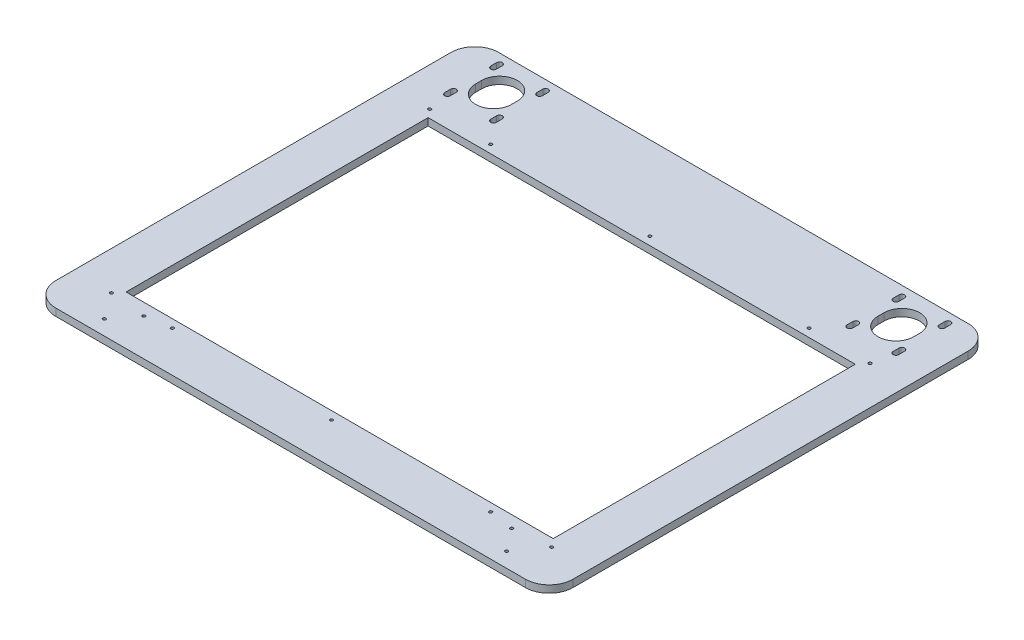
ISO-10303-21;
HEADER;
FILE_DESCRIPTION(('STEP AP214'),'2;1');
FILE_NAME('part.step','',(''),(''),'','','');
FILE_SCHEMA(('AUTOMOTIVE_DESIGN { 1 0 10303 214 1 1 1 1 }'));
ENDSEC;
DATA;
#1=APPLICATION_CONTEXT('core data for automotive mechanical design processes');
#2=APPLICATION_PROTOCOL_DEFINITION('international standard','automotive_design',2000,#1);
#3=PRODUCT_CONTEXT('',#1,'mechanical');
#4=PRODUCT('Part','Part','',(#3));
#5=PRODUCT_RELATED_PRODUCT_CATEGORY('part','',(#4));
#6=PRODUCT_DEFINITION_FORMATION('','',#4);
#7=PRODUCT_DEFINITION_CONTEXT('part definition',#1,'design');
#8=PRODUCT_DEFINITION('design','',#6,#7);
#9=PRODUCT_DEFINITION_SHAPE('','',#8);
#10=(LENGTH_UNIT() NAMED_UNIT(*) SI_UNIT(.MILLI.,.METRE.));
#11=(NAMED_UNIT(*) PLANE_ANGLE_UNIT() SI_UNIT($,.RADIAN.));
#12=(NAMED_UNIT(*) SI_UNIT($,.STERADIAN.) SOLID_ANGLE_UNIT());
#13=UNCERTAINTY_MEASURE_WITH_UNIT(LENGTH_MEASURE(1.E-05),#10,'distance_accuracy_value','');
#14=(GEOMETRIC_REPRESENTATION_CONTEXT(3) GLOBAL_UNCERTAINTY_ASSIGNED_CONTEXT((#13)) GLOBAL_UNIT_ASSIGNED_CONTEXT((#10,
#11,#12)) REPRESENTATION_CONTEXT('',''));
#15=CARTESIAN_POINT('',(0.,0.,0.));
#16=DIRECTION('',(0.,0.,1.));
#17=DIRECTION('',(1.,0.,0.));
#18=AXIS2_PLACEMENT_3D('',#15,#16,#17);
#19=CARTESIAN_POINT('',(-174.,4.9,134.6));
#20=DIRECTION('',(0.,1.,0.));
#21=DIRECTION('',(0.,0.,1.));
#22=AXIS2_PLACEMENT_3D('',#19,#20,#21);
#23=PLANE('',#22);
#24=CARTESIAN_POINT('',(-148.1125,4.9,-107.1));
#25=DIRECTION('',(0.,1.,0.));
#26=DIRECTION('',(0.,0.,1.));
#27=AXIS2_PLACEMENT_3D('',#24,#25,#26);
#28=CIRCLE('',#27,0.999999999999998);
#29=CARTESIAN_POINT('',(-148.1125,4.9,-106.1));
#30=VERTEX_POINT('',#29);
#31=EDGE_CURVE('E1643',#30,#30,#28,.T.);
#32=ORIENTED_EDGE('',*,*,#31,.F.);
#33=EDGE_LOOP('',(#32));
#34=FACE_BOUND('',#33,.T.);
#35=CARTESIAN_POINT('',(-107.1125,4.9,-107.1));
#36=DIRECTION('',(0.,1.,0.));
#37=DIRECTION('',(0.,0.,1.));
#38=AXIS2_PLACEMENT_3D('',#35,#36,#37);
#39=CIRCLE('',#38,0.999999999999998);
#40=CARTESIAN_POINT('',(-107.1125,4.9,-106.1));
#41=VERTEX_POINT('',#40);
#42=EDGE_CURVE('E1637',#41,#41,#39,.T.);
#43=ORIENTED_EDGE('',*,*,#42,.F.);
#44=EDGE_LOOP('',(#43));
#45=FACE_BOUND('',#44,.T.);
#46=CARTESIAN_POINT('',(0.,4.9,-107.1));
#47=DIRECTION('',(0.,1.,0.));
#48=DIRECTION('',(0.,0.,1.));
#49=AXIS2_PLACEMENT_3D('',#46,#47,#48);
#50=CIRCLE('',#49,1.);
#51=CARTESIAN_POINT('',(0.,4.9,-106.1));
#52=VERTEX_POINT('',#51);
#53=EDGE_CURVE('E1631',#52,#52,#50,.T.);
#54=ORIENTED_EDGE('',*,*,#53,.F.);
#55=EDGE_LOOP('',(#54));
#56=FACE_BOUND('',#55,.T.);
#57=CARTESIAN_POINT('',(107.1125,4.9,-107.1));
#58=DIRECTION('',(0.,1.,0.));
#59=DIRECTION('',(0.,0.,1.));
#60=AXIS2_PLACEMENT_3D('',#57,#58,#59);
#61=CIRCLE('',#60,0.999999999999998);
#62=CARTESIAN_POINT('',(107.1125,4.9,-106.1));
#63=VERTEX_POINT('',#62);
#64=EDGE_CURVE('E1625',#63,#63,#61,.T.);
#65=ORIENTED_EDGE('',*,*,#64,.F.);
#66=EDGE_LOOP('',(#65));
#67=FACE_BOUND('',#66,.T.);
#68=CARTESIAN_POINT('',(148.1125,4.9,-107.1));
#69=DIRECTION('',(0.,1.,0.));
#70=DIRECTION('',(0.,0.,1.));
#71=AXIS2_PLACEMENT_3D('',#68,#69,#70);
#72=CIRCLE('',#71,0.999999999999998);
#73=CARTESIAN_POINT('',(148.1125,4.9,-106.1));
#74=VERTEX_POINT('',#73);
#75=EDGE_CURVE('E1619',#74,#74,#72,.T.);
#76=ORIENTED_EDGE('',*,*,#75,.F.);
#77=EDGE_LOOP('',(#76));
#78=FACE_BOUND('',#77,.T.);
#79=CARTESIAN_POINT('',(148.1125,4.9,107.1));
#80=DIRECTION('',(0.,1.,0.));
#81=DIRECTION('',(0.,0.,1.));
#82=AXIS2_PLACEMENT_3D('',#79,#80,#81);
#83=CIRCLE('',#82,0.999999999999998);
#84=CARTESIAN_POINT('',(148.1125,4.9,108.1));
#85=VERTEX_POINT('',#84);
#86=EDGE_CURVE('E1613',#85,#85,#83,.T.);
#87=ORIENTED_EDGE('',*,*,#86,.F.);
#88=EDGE_LOOP('',(#87));
#89=FACE_BOUND('',#88,.T.);
#90=CARTESIAN_POINT('',(107.1125,4.9,107.1));
#91=DIRECTION('',(0.,1.,0.));
#92=DIRECTION('',(0.,0.,1.));
#93=AXIS2_PLACEMENT_3D('',#90,#91,#92);
#94=CIRCLE('',#93,0.999999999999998);
#95=CARTESIAN_POINT('',(107.1125,4.9,108.1));
#96=VERTEX_POINT('',#95);
#97=EDGE_CURVE('E1607',#96,#96,#94,.T.);
#98=ORIENTED_EDGE('',*,*,#97,.F.);
#99=EDGE_LOOP('',(#98));
#100=FACE_BOUND('',#99,.T.);
#101=CARTESIAN_POINT('',(0.,4.9,107.1));
#102=DIRECTION('',(0.,1.,0.));
#103=DIRECTION('',(0.,0.,1.));
#104=AXIS2_PLACEMENT_3D('',#101,#102,#103);
#105=CIRCLE('',#104,1.);
#106=CARTESIAN_POINT('',(0.,4.9,108.1));
#107=VERTEX_POINT('',#106);
#108=EDGE_CURVE('E1601',#107,#107,#105,.T.);
#109=ORIENTED_EDGE('',*,*,#108,.F.);
#110=EDGE_LOOP('',(#109));
#111=FACE_BOUND('',#110,.T.);
#112=CARTESIAN_POINT('',(-107.1125,4.9,107.1));
#113=DIRECTION('',(0.,1.,0.));
#114=DIRECTION('',(0.,0.,1.));
#115=AXIS2_PLACEMENT_3D('',#112,#113,#114);
#116=CIRCLE('',#115,0.999999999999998);
#117=CARTESIAN_POINT('',(-107.1125,4.9,108.1));
#118=VERTEX_POINT('',#117);
#119=EDGE_CURVE('E1595',#118,#118,#116,.T.);
#120=ORIENTED_EDGE('',*,*,#119,.F.);
#121=EDGE_LOOP('',(#120));
#122=FACE_BOUND('',#121,.T.);
#123=CARTESIAN_POINT('',(-148.1125,4.9,107.1));
#124=DIRECTION('',(0.,1.,0.));
#125=DIRECTION('',(0.,0.,1.));
#126=AXIS2_PLACEMENT_3D('',#123,#124,#125);
#127=CIRCLE('',#126,0.999999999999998);
#128=CARTESIAN_POINT('',(-148.1125,4.9,108.1));
#129=VERTEX_POINT('',#128);
#130=EDGE_CURVE('E1589',#129,#129,#127,.T.);
#131=ORIENTED_EDGE('',*,*,#130,.F.);
#132=EDGE_LOOP('',(#131));
#133=FACE_BOUND('',#132,.T.);
#134=CARTESIAN_POINT('',(123.75,4.9,109.6));
#135=DIRECTION('',(0.,1.,0.));
#136=DIRECTION('',(0.,0.,-1.));
#137=AXIS2_PLACEMENT_3D('',#134,#135,#136);
#138=CIRCLE('',#137,0.999999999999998);
#139=CARTESIAN_POINT('',(123.75,4.9,108.6));
#140=VERTEX_POINT('',#139);
#141=EDGE_CURVE('E759',#140,#140,#138,.T.);
#142=ORIENTED_EDGE('',*,*,#141,.F.);
#143=EDGE_LOOP('',(#142));
#144=FACE_BOUND('',#143,.T.);
#145=CARTESIAN_POINT('',(135.35,4.9,124.6));
#146=DIRECTION('',(0.,1.,0.));
#147=DIRECTION('',(0.,0.,-1.));
#148=AXIS2_PLACEMENT_3D('',#145,#146,#147);
#149=CIRCLE('',#148,0.999999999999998);
#150=CARTESIAN_POINT('',(135.35,4.9,123.6));
#151=VERTEX_POINT('',#150);
#152=EDGE_CURVE('E755',#151,#151,#149,.T.);
#153=ORIENTED_EDGE('',*,*,#152,.F.);
#154=EDGE_LOOP('',(#153));
#155=FACE_BOUND('',#154,.T.);
#156=CARTESIAN_POINT('',(-135.35,4.9,124.6));
#157=DIRECTION('',(0.,1.,0.));
#158=DIRECTION('',(0.,0.,1.));
#159=AXIS2_PLACEMENT_3D('',#156,#157,#158);
#160=CIRCLE('',#159,0.999999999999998);
#161=CARTESIAN_POINT('',(-135.35,4.9,125.6));
#162=VERTEX_POINT('',#161);
#163=EDGE_CURVE('E751',#162,#162,#160,.T.);
#164=ORIENTED_EDGE('',*,*,#163,.F.);
#165=EDGE_LOOP('',(#164));
#166=FACE_BOUND('',#165,.T.);
#167=CARTESIAN_POINT('',(-123.75,4.9,109.6));
#168=DIRECTION('',(0.,1.,0.));
#169=DIRECTION('',(0.,0.,1.));
#170=AXIS2_PLACEMENT_3D('',#167,#168,#169);
#171=CIRCLE('',#170,0.999999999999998);
#172=CARTESIAN_POINT('',(-123.75,4.9,110.6));
#173=VERTEX_POINT('',#172);
#174=EDGE_CURVE('E747',#173,#173,#171,.T.);
#175=ORIENTED_EDGE('',*,*,#174,.F.);
#176=EDGE_LOOP('',(#175));
#177=FACE_BOUND('',#176,.T.);
#178=CARTESIAN_POINT('',(135.35,4.9,-137.3));
#179=DIRECTION('',(0.,1.,0.));
#180=DIRECTION('',(0.,0.,1.));
#181=AXIS2_PLACEMENT_3D('',#178,#179,#180);
#182=CIRCLE('',#181,12.);
#183=CARTESIAN_POINT('',(123.35,4.9,-137.3));
#184=VERTEX_POINT('',#183);
#185=CARTESIAN_POINT('',(147.35,4.9,-137.3));
#186=VERTEX_POINT('',#185);
#187=EDGE_CURVE('E381',#184,#186,#182,.T.);
#188=ORIENTED_EDGE('',*,*,#187,.F.);
#189=DIRECTION('',(0.,0.,1.));
#190=VECTOR('',#189,1.);
#191=CARTESIAN_POINT('',(123.35,4.9,-137.3));
#192=LINE('',#191,#190);
#193=CARTESIAN_POINT('',(123.35,4.9,-141.3));
#194=VERTEX_POINT('',#193);
#195=EDGE_CURVE('E385',#194,#184,#192,.T.);
#196=ORIENTED_EDGE('',*,*,#195,.F.);
#197=CARTESIAN_POINT('',(135.35,4.9,-141.3));
#198=DIRECTION('',(0.,1.,0.));
#199=DIRECTION('',(0.,0.,1.));
#200=AXIS2_PLACEMENT_3D('',#197,#198,#199);
#201=CIRCLE('',#200,12.);
#202=CARTESIAN_POINT('',(147.35,4.9,-141.3));
#203=VERTEX_POINT('',#202);
#204=EDGE_CURVE('E365',#203,#194,#201,.T.);
#205=ORIENTED_EDGE('',*,*,#204,.F.);
#206=DIRECTION('',(0.,0.,-1.));
#207=VECTOR('',#206,1.);
#208=CARTESIAN_POINT('',(147.35,4.9,-137.3));
#209=LINE('',#208,#207);
#210=EDGE_CURVE('E376',#186,#203,#209,.T.);
#211=ORIENTED_EDGE('',*,*,#210,.F.);
#212=EDGE_LOOP('',(#188,#196,#205,#211));
#213=FACE_BOUND('',#212,.T.);
#214=CARTESIAN_POINT('',(119.85,4.9,-121.8));
#215=DIRECTION('',(0.,1.,0.));
#216=DIRECTION('',(0.,0.,1.));
#217=AXIS2_PLACEMENT_3D('',#214,#215,#216);
#218=CIRCLE('',#217,1.87500000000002);
#219=CARTESIAN_POINT('',(117.975,4.9,-121.8));
#220=VERTEX_POINT('',#219);
#221=CARTESIAN_POINT('',(121.725,4.9,-121.8));
#222=VERTEX_POINT('',#221);
#223=EDGE_CURVE('E392',#220,#222,#218,.T.);
#224=ORIENTED_EDGE('',*,*,#223,.F.);
#225=DIRECTION('',(0.,0.,1.));
#226=VECTOR('',#225,1.);
#227=CARTESIAN_POINT('',(117.975,4.9,-121.8));
#228=LINE('',#227,#226);
#229=CARTESIAN_POINT('',(117.975,4.9,-125.8));
#230=VERTEX_POINT('',#229);
#231=EDGE_CURVE('E402',#230,#220,#228,.T.);
#232=ORIENTED_EDGE('',*,*,#231,.F.);
#233=CARTESIAN_POINT('',(119.85,4.9,-125.8));
#234=DIRECTION('',(0.,1.,0.));
#235=DIRECTION('',(0.,0.,1.));
#236=AXIS2_PLACEMENT_3D('',#233,#234,#235);
#237=CIRCLE('',#236,1.87500000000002);
#238=CARTESIAN_POINT('',(121.725,4.9,-125.8));
#239=VERTEX_POINT('',#238);
#240=EDGE_CURVE('E399',#239,#230,#237,.T.);
#241=ORIENTED_EDGE('',*,*,#240,.F.);
#242=DIRECTION('',(0.,0.,-1.));
#243=VECTOR('',#242,1.);
#244=CARTESIAN_POINT('',(121.725,4.9,-121.8));
#245=LINE('',#244,#243);
#246=EDGE_CURVE('E396',#222,#239,#245,.T.);
#247=ORIENTED_EDGE('',*,*,#246,.F.);
#248=EDGE_LOOP('',(#224,#232,#241,#247));
#249=FACE_BOUND('',#248,.T.);
#250=CARTESIAN_POINT('',(150.85,4.9,-121.8));
#251=DIRECTION('',(0.,1.,0.));
#252=DIRECTION('',(0.,0.,1.));
#253=AXIS2_PLACEMENT_3D('',#250,#251,#252);
#254=CIRCLE('',#253,1.87499999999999);
#255=CARTESIAN_POINT('',(148.975,4.9,-121.8));
#256=VERTEX_POINT('',#255);
#257=CARTESIAN_POINT('',(152.725,4.9,-121.8));
#258=VERTEX_POINT('',#257);
#259=EDGE_CURVE('E408',#256,#258,#254,.T.);
#260=ORIENTED_EDGE('',*,*,#259,.F.);
#261=DIRECTION('',(0.,0.,1.));
#262=VECTOR('',#261,1.);
#263=CARTESIAN_POINT('',(148.975,4.9,-121.8));
#264=LINE('',#263,#262);
#265=CARTESIAN_POINT('',(148.975,4.9,-125.8));
#266=VERTEX_POINT('',#265);
#267=EDGE_CURVE('E422',#266,#256,#264,.T.);
#268=ORIENTED_EDGE('',*,*,#267,.F.);
#269=CARTESIAN_POINT('',(150.85,4.9,-125.8));
#270=DIRECTION('',(0.,1.,0.));
#271=DIRECTION('',(0.,0.,1.));
#272=AXIS2_PLACEMENT_3D('',#269,#270,#271);
#273=CIRCLE('',#272,1.87499999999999);
#274=CARTESIAN_POINT('',(152.725,4.9,-125.8));
#275=VERTEX_POINT('',#274);
#276=EDGE_CURVE('E419',#275,#266,#273,.T.);
#277=ORIENTED_EDGE('',*,*,#276,.F.);
#278=DIRECTION('',(0.,0.,-1.));
#279=VECTOR('',#278,1.);
#280=CARTESIAN_POINT('',(152.725,4.9,-121.8));
#281=LINE('',#280,#279);
#282=EDGE_CURVE('E416',#258,#275,#281,.T.);
#283=ORIENTED_EDGE('',*,*,#282,.F.);
#284=EDGE_LOOP('',(#260,#268,#277,#283));
#285=FACE_BOUND('',#284,.T.);
#286=CARTESIAN_POINT('',(150.85,4.9,-152.8));
#287=DIRECTION('',(0.,1.,0.));
#288=DIRECTION('',(0.,0.,1.));
#289=AXIS2_PLACEMENT_3D('',#286,#287,#288);
#290=CIRCLE('',#289,1.87499999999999);
#291=CARTESIAN_POINT('',(148.975,4.9,-152.8));
#292=VERTEX_POINT('',#291);
#293=CARTESIAN_POINT('',(152.725,4.9,-152.8));
#294=VERTEX_POINT('',#293);
#295=EDGE_CURVE('E428',#292,#294,#290,.T.);
#296=ORIENTED_EDGE('',*,*,#295,.F.);
#297=DIRECTION('',(0.,0.,1.));
#298=VECTOR('',#297,1.);
#299=CARTESIAN_POINT('',(148.975,4.9,-152.8));
#300=LINE('',#299,#298);
#301=CARTESIAN_POINT('',(148.975,4.9,-156.8));
#302=VERTEX_POINT('',#301);
#303=EDGE_CURVE('E442',#302,#292,#300,.T.);
#304=ORIENTED_EDGE('',*,*,#303,.F.);
#305=CARTESIAN_POINT('',(150.85,4.9,-156.8));
#306=DIRECTION('',(0.,1.,0.));
#307=DIRECTION('',(0.,0.,1.));
#308=AXIS2_PLACEMENT_3D('',#305,#306,#307);
#309=CIRCLE('',#308,1.87499999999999);
#310=CARTESIAN_POINT('',(152.725,4.9,-156.8));
#311=VERTEX_POINT('',#310);
#312=EDGE_CURVE('E439',#311,#302,#309,.T.);
#313=ORIENTED_EDGE('',*,*,#312,.F.);
#314=DIRECTION('',(0.,0.,-1.));
#315=VECTOR('',#314,1.);
#316=CARTESIAN_POINT('',(152.725,4.9,-152.8));
#317=LINE('',#316,#315);
#318=EDGE_CURVE('E436',#294,#311,#317,.T.);
#319=ORIENTED_EDGE('',*,*,#318,.F.);
#320=EDGE_LOOP('',(#296,#304,#313,#319));
#321=FACE_BOUND('',#320,.T.);
#322=CARTESIAN_POINT('',(119.85,4.9,-152.8));
#323=DIRECTION('',(0.,1.,0.));
#324=DIRECTION('',(0.,0.,1.));
#325=AXIS2_PLACEMENT_3D('',#322,#323,#324);
#326=CIRCLE('',#325,1.87499999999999);
#327=CARTESIAN_POINT('',(117.975,4.9,-152.8));
#328=VERTEX_POINT('',#327);
#329=CARTESIAN_POINT('',(121.725,4.9,-152.8));
#330=VERTEX_POINT('',#329);
#331=EDGE_CURVE('E448',#328,#330,#326,.T.);
#332=ORIENTED_EDGE('',*,*,#331,.F.);
#333=DIRECTION('',(0.,0.,1.));
#334=VECTOR('',#333,1.);
#335=CARTESIAN_POINT('',(117.975,4.9,-152.8));
#336=LINE('',#335,#334);
#337=CARTESIAN_POINT('',(117.975,4.9,-156.8));
#338=VERTEX_POINT('',#337);
#339=EDGE_CURVE('E462',#338,#328,#336,.T.);
#340=ORIENTED_EDGE('',*,*,#339,.F.);
#341=CARTESIAN_POINT('',(119.85,4.9,-156.8));
#342=DIRECTION('',(0.,1.,0.));
#343=DIRECTION('',(0.,0.,1.));
#344=AXIS2_PLACEMENT_3D('',#341,#342,#343);
#345=CIRCLE('',#344,1.87499999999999);
#346=CARTESIAN_POINT('',(121.725,4.9,-156.8));
#347=VERTEX_POINT('',#346);
#348=EDGE_CURVE('E459',#347,#338,#345,.T.);
#349=ORIENTED_EDGE('',*,*,#348,.F.);
#350=DIRECTION('',(0.,0.,-1.));
#351=VECTOR('',#350,1.);
#352=CARTESIAN_POINT('',(121.725,4.9,-152.8));
#353=LINE('',#352,#351);
#354=EDGE_CURVE('E456',#330,#347,#353,.T.);
#355=ORIENTED_EDGE('',*,*,#354,.F.);
#356=EDGE_LOOP('',(#332,#340,#349,#355));
#357=FACE_BOUND('',#356,.T.);
#358=CARTESIAN_POINT('',(-135.35,4.9,-137.3));
#359=DIRECTION('',(0.,1.,0.));
#360=DIRECTION('',(0.,0.,1.));
#361=AXIS2_PLACEMENT_3D('',#358,#359,#360);
#362=CIRCLE('',#361,12.);
#363=CARTESIAN_POINT('',(-147.35,4.9,-137.3));
#364=VERTEX_POINT('',#363);
#365=CARTESIAN_POINT('',(-123.35,4.9,-137.3));
#366=VERTEX_POINT('',#365);
#367=EDGE_CURVE('E468',#364,#366,#362,.T.);
#368=ORIENTED_EDGE('',*,*,#367,.F.);
#369=DIRECTION('',(0.,0.,1.));
#370=VECTOR('',#369,1.);
#371=CARTESIAN_POINT('',(-147.35,4.9,-137.3));
#372=LINE('',#371,#370);
#373=CARTESIAN_POINT('',(-147.35,4.9,-141.3));
#374=VERTEX_POINT('',#373);
#375=EDGE_CURVE('E482',#374,#364,#372,.T.);
#376=ORIENTED_EDGE('',*,*,#375,.F.);
#377=CARTESIAN_POINT('',(-135.35,4.9,-141.3));
#378=DIRECTION('',(0.,1.,0.));
#379=DIRECTION('',(0.,0.,1.));
#380=AXIS2_PLACEMENT_3D('',#377,#378,#379);
#381=CIRCLE('',#380,12.);
#382=CARTESIAN_POINT('',(-123.35,4.9,-141.3));
#383=VERTEX_POINT('',#382);
#384=EDGE_CURVE('E479',#383,#374,#381,.T.);
#385=ORIENTED_EDGE('',*,*,#384,.F.);
#386=DIRECTION('',(0.,0.,-1.));
#387=VECTOR('',#386,1.);
#388=CARTESIAN_POINT('',(-123.35,4.9,-137.3));
#389=LINE('',#388,#387);
#390=EDGE_CURVE('E476',#366,#383,#389,.T.);
#391=ORIENTED_EDGE('',*,*,#390,.F.);
#392=EDGE_LOOP('',(#368,#376,#385,#391));
#393=FACE_BOUND('',#392,.T.);
#394=CARTESIAN_POINT('',(-119.85,4.9,-121.8));
#395=DIRECTION('',(0.,1.,0.));
#396=DIRECTION('',(0.,0.,1.));
#397=AXIS2_PLACEMENT_3D('',#394,#395,#396);
#398=CIRCLE('',#397,1.87499999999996);
#399=CARTESIAN_POINT('',(-121.725,4.9,-121.8));
#400=VERTEX_POINT('',#399);
#401=CARTESIAN_POINT('',(-117.975,4.9,-121.8));
#402=VERTEX_POINT('',#401);
#403=EDGE_CURVE('E488',#400,#402,#398,.T.);
#404=ORIENTED_EDGE('',*,*,#403,.F.);
#405=DIRECTION('',(0.,0.,1.));
#406=VECTOR('',#405,1.);
#407=CARTESIAN_POINT('',(-121.725,4.9,-121.8));
#408=LINE('',#407,#406);
#409=CARTESIAN_POINT('',(-121.725,4.9,-125.8));
#410=VERTEX_POINT('',#409);
#411=EDGE_CURVE('E502',#410,#400,#408,.T.);
#412=ORIENTED_EDGE('',*,*,#411,.F.);
#413=CARTESIAN_POINT('',(-119.85,4.9,-125.8));
#414=DIRECTION('',(0.,1.,0.));
#415=DIRECTION('',(0.,0.,1.));
#416=AXIS2_PLACEMENT_3D('',#413,#414,#415);
#417=CIRCLE('',#416,1.87499999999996);
#418=CARTESIAN_POINT('',(-117.975,4.9,-125.8));
#419=VERTEX_POINT('',#418);
#420=EDGE_CURVE('E499',#419,#410,#417,.T.);
#421=ORIENTED_EDGE('',*,*,#420,.F.);
#422=DIRECTION('',(0.,0.,-1.));
#423=VECTOR('',#422,1.);
#424=CARTESIAN_POINT('',(-117.975,4.9,-121.8));
#425=LINE('',#424,#423);
#426=EDGE_CURVE('E496',#402,#419,#425,.T.);
#427=ORIENTED_EDGE('',*,*,#426,.F.);
#428=EDGE_LOOP('',(#404,#412,#421,#427));
#429=FACE_BOUND('',#428,.T.);
#430=CARTESIAN_POINT('',(-150.85,4.9,-121.8));
#431=DIRECTION('',(0.,1.,0.));
#432=DIRECTION('',(0.,0.,1.));
#433=AXIS2_PLACEMENT_3D('',#430,#431,#432);
#434=CIRCLE('',#433,1.87499999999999);
#435=CARTESIAN_POINT('',(-152.725,4.9,-121.8));
#436=VERTEX_POINT('',#435);
#437=CARTESIAN_POINT('',(-148.975,4.9,-121.8));
#438=VERTEX_POINT('',#437);
#439=EDGE_CURVE('E508',#436,#438,#434,.T.);
#440=ORIENTED_EDGE('',*,*,#439,.F.);
#441=DIRECTION('',(0.,0.,1.));
#442=VECTOR('',#441,1.);
#443=CARTESIAN_POINT('',(-152.725,4.9,-121.8));
#444=LINE('',#443,#442);
#445=CARTESIAN_POINT('',(-152.725,4.9,-125.8));
#446=VERTEX_POINT('',#445);
#447=EDGE_CURVE('E522',#446,#436,#444,.T.);
#448=ORIENTED_EDGE('',*,*,#447,.F.);
#449=CARTESIAN_POINT('',(-150.85,4.9,-125.8));
#450=DIRECTION('',(0.,1.,0.));
#451=DIRECTION('',(0.,0.,1.));
#452=AXIS2_PLACEMENT_3D('',#449,#450,#451);
#453=CIRCLE('',#452,1.87499999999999);
#454=CARTESIAN_POINT('',(-148.975,4.9,-125.8));
#455=VERTEX_POINT('',#454);
#456=EDGE_CURVE('E519',#455,#446,#453,.T.);
#457=ORIENTED_EDGE('',*,*,#456,.F.);
#458=DIRECTION('',(0.,0.,-1.));
#459=VECTOR('',#458,1.);
#460=CARTESIAN_POINT('',(-148.975,4.9,-121.8));
#461=LINE('',#460,#459);
#462=EDGE_CURVE('E516',#438,#455,#461,.T.);
#463=ORIENTED_EDGE('',*,*,#462,.F.);
#464=EDGE_LOOP('',(#440,#448,#457,#463));
#465=FACE_BOUND('',#464,.T.);
#466=CARTESIAN_POINT('',(-119.85,4.9,-152.8));
#467=DIRECTION('',(0.,1.,0.));
#468=DIRECTION('',(0.,0.,1.));
#469=AXIS2_PLACEMENT_3D('',#466,#467,#468);
#470=CIRCLE('',#469,1.87499999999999);
#471=CARTESIAN_POINT('',(-121.725,4.9,-152.8));
#472=VERTEX_POINT('',#471);
#473=CARTESIAN_POINT('',(-117.975,4.9,-152.8));
#474=VERTEX_POINT('',#473);
#475=EDGE_CURVE('E528',#472,#474,#470,.T.);
#476=ORIENTED_EDGE('',*,*,#475,.F.);
#477=DIRECTION('',(0.,0.,1.));
#478=VECTOR('',#477,1.);
#479=CARTESIAN_POINT('',(-121.725,4.9,-152.8));
#480=LINE('',#479,#478);
#481=CARTESIAN_POINT('',(-121.725,4.9,-156.8));
#482=VERTEX_POINT('',#481);
#483=EDGE_CURVE('E542',#482,#472,#480,.T.);
#484=ORIENTED_EDGE('',*,*,#483,.F.);
#485=CARTESIAN_POINT('',(-119.85,4.9,-156.8));
#486=DIRECTION('',(0.,1.,0.));
#487=DIRECTION('',(0.,0.,1.));
#488=AXIS2_PLACEMENT_3D('',#485,#486,#487);
#489=CIRCLE('',#488,1.87499999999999);
#490=CARTESIAN_POINT('',(-117.975,4.9,-156.8));
#491=VERTEX_POINT('',#490);
#492=EDGE_CURVE('E539',#491,#482,#489,.T.);
#493=ORIENTED_EDGE('',*,*,#492,.F.);
#494=DIRECTION('',(0.,0.,-1.));
#495=VECTOR('',#494,1.);
#496=CARTESIAN_POINT('',(-117.975,4.9,-152.8));
#497=LINE('',#496,#495);
#498=EDGE_CURVE('E536',#474,#491,#497,.T.);
#499=ORIENTED_EDGE('',*,*,#498,.F.);
#500=EDGE_LOOP('',(#476,#484,#493,#499));
#501=FACE_BOUND('',#500,.T.);
#502=CARTESIAN_POINT('',(-150.85,4.9,-152.8));
#503=DIRECTION('',(0.,1.,0.));
#504=DIRECTION('',(0.,0.,1.));
#505=AXIS2_PLACEMENT_3D('',#502,#503,#504);
#506=CIRCLE('',#505,1.87499999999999);
#507=CARTESIAN_POINT('',(-152.725,4.9,-152.8));
#508=VERTEX_POINT('',#507);
#509=CARTESIAN_POINT('',(-148.975,4.9,-152.8));
#510=VERTEX_POINT('',#509);
#511=EDGE_CURVE('E548',#508,#510,#506,.T.);
#512=ORIENTED_EDGE('',*,*,#511,.F.);
#513=DIRECTION('',(0.,0.,1.));
#514=VECTOR('',#513,1.);
#515=CARTESIAN_POINT('',(-152.725,4.9,-152.8));
#516=LINE('',#515,#514);
#517=CARTESIAN_POINT('',(-152.725,4.9,-156.8));
#518=VERTEX_POINT('',#517);
#519=EDGE_CURVE('E562',#518,#508,#516,.T.);
#520=ORIENTED_EDGE('',*,*,#519,.F.);
#521=CARTESIAN_POINT('',(-150.85,4.9,-156.8));
#522=DIRECTION('',(0.,1.,0.));
#523=DIRECTION('',(0.,0.,1.));
#524=AXIS2_PLACEMENT_3D('',#521,#522,#523);
#525=CIRCLE('',#524,1.87499999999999);
#526=CARTESIAN_POINT('',(-148.975,4.9,-156.8));
#527=VERTEX_POINT('',#526);
#528=EDGE_CURVE('E559',#527,#518,#525,.T.);
#529=ORIENTED_EDGE('',*,*,#528,.F.);
#530=DIRECTION('',(0.,0.,-1.));
#531=VECTOR('',#530,1.);
#532=CARTESIAN_POINT('',(-148.975,4.9,-152.8));
#533=LINE('',#532,#531);
#534=EDGE_CURVE('E556',#510,#527,#533,.T.);
#535=ORIENTED_EDGE('',*,*,#534,.F.);
#536=EDGE_LOOP('',(#512,#520,#529,#535));
#537=FACE_BOUND('',#536,.T.);
#538=DIRECTION('',(0.,0.,-1.));
#539=VECTOR('',#538,1.);
#540=CARTESIAN_POINT('',(174.,4.9,-163.3));
#541=LINE('',#540,#539);
#542=CARTESIAN_POINT('',(174.,4.9,118.6));
#543=VERTEX_POINT('',#542);
#544=CARTESIAN_POINT('',(174.,4.9,-147.3));
#545=VERTEX_POINT('',#544);
#546=EDGE_CURVE('E611',#543,#545,#541,.T.);
#547=ORIENTED_EDGE('',*,*,#546,.T.);
#548=CARTESIAN_POINT('',(158.,4.9,-147.3));
#549=DIRECTION('',(0.,1.,0.));
#550=DIRECTION('',(0.,0.,1.));
#551=AXIS2_PLACEMENT_3D('',#548,#549,#550);
#552=CIRCLE('',#551,16.);
#553=CARTESIAN_POINT('',(158.,4.9,-163.3));
#554=VERTEX_POINT('',#553);
#555=EDGE_CURVE('E782',#545,#554,#552,.T.);
#556=ORIENTED_EDGE('',*,*,#555,.T.);
#557=DIRECTION('',(-1.,0.,0.));
#558=VECTOR('',#557,1.);
#559=CARTESIAN_POINT('',(-174.,4.9,-163.3));
#560=LINE('',#559,#558);
#561=CARTESIAN_POINT('',(-158.,4.9,-163.3));
#562=VERTEX_POINT('',#561);
#563=EDGE_CURVE('E614',#554,#562,#560,.T.);
#564=ORIENTED_EDGE('',*,*,#563,.T.);
#565=CARTESIAN_POINT('',(-158.,4.9,-147.3));
#566=DIRECTION('',(0.,1.,0.));
#567=DIRECTION('',(0.,0.,1.));
#568=AXIS2_PLACEMENT_3D('',#565,#566,#567);
#569=CIRCLE('',#568,16.);
#570=CARTESIAN_POINT('',(-174.,4.9,-147.3));
#571=VERTEX_POINT('',#570);
#572=EDGE_CURVE('E777',#562,#571,#569,.T.);
#573=ORIENTED_EDGE('',*,*,#572,.T.);
#574=DIRECTION('',(0.,0.,1.));
#575=VECTOR('',#574,1.);
#576=CARTESIAN_POINT('',(-174.,4.9,-163.3));
#577=LINE('',#576,#575);
#578=CARTESIAN_POINT('',(-174.,4.9,118.6));
#579=VERTEX_POINT('',#578);
#580=EDGE_CURVE('E606',#571,#579,#577,.T.);
#581=ORIENTED_EDGE('',*,*,#580,.T.);
#582=CARTESIAN_POINT('',(-158.,4.9,118.6));
#583=DIRECTION('',(0.,1.,0.));
#584=DIRECTION('',(0.,0.,1.));
#585=AXIS2_PLACEMENT_3D('',#582,#583,#584);
#586=CIRCLE('',#585,16.);
#587=CARTESIAN_POINT('',(-158.,4.9,134.6));
#588=VERTEX_POINT('',#587);
#589=EDGE_CURVE('E52',#579,#588,#586,.T.);
#590=ORIENTED_EDGE('',*,*,#589,.T.);
#591=DIRECTION('',(1.,0.,0.));
#592=VECTOR('',#591,1.);
#593=CARTESIAN_POINT('',(-174.,4.9,134.6));
#594=LINE('',#593,#592);
#595=CARTESIAN_POINT('',(158.,4.9,134.6));
#596=VERTEX_POINT('',#595);
#597=EDGE_CURVE('E608',#588,#596,#594,.T.);
#598=ORIENTED_EDGE('',*,*,#597,.T.);
#599=CARTESIAN_POINT('',(158.,4.9,118.6));
#600=DIRECTION('',(0.,1.,0.));
#601=DIRECTION('',(0.,0.,1.));
#602=AXIS2_PLACEMENT_3D('',#599,#600,#601);
#603=CIRCLE('',#602,16.);
#604=EDGE_CURVE('E780',#596,#543,#603,.T.);
#605=ORIENTED_EDGE('',*,*,#604,.T.);
#606=EDGE_LOOP('',(#547,#556,#564,#573,#581,#590,#598,#605));
#607=FACE_BOUND('',#606,.T.);
#608=DIRECTION('',(1.,0.,0.));
#609=VECTOR('',#608,1.);
#610=CARTESIAN_POINT('',(-143.7,4.9,101.6));
#611=LINE('',#610,#609);
#612=CARTESIAN_POINT('',(-143.7,4.9,101.6));
#613=VERTEX_POINT('',#612);
#614=CARTESIAN_POINT('',(143.7,4.9,101.6));
#615=VERTEX_POINT('',#614);
#616=EDGE_CURVE('E577',#613,#615,#611,.T.);
#617=ORIENTED_EDGE('',*,*,#616,.F.);
#618=DIRECTION('',(0.,0.,1.));
#619=VECTOR('',#618,1.);
#620=CARTESIAN_POINT('',(-143.7,4.9,-101.6));
#621=LINE('',#620,#619);
#622=CARTESIAN_POINT('',(-143.7,4.9,-101.6));
#623=VERTEX_POINT('',#622);
#624=EDGE_CURVE('E575',#623,#613,#621,.T.);
#625=ORIENTED_EDGE('',*,*,#624,.F.);
#626=DIRECTION('',(-1.,0.,0.));
#627=VECTOR('',#626,1.);
#628=CARTESIAN_POINT('',(-143.7,4.9,-101.6));
#629=LINE('',#628,#627);
#630=CARTESIAN_POINT('',(143.7,4.9,-101.6));
#631=VERTEX_POINT('',#630);
#632=EDGE_CURVE('E583',#631,#623,#629,.T.);
#633=ORIENTED_EDGE('',*,*,#632,.F.);
#634=DIRECTION('',(0.,0.,-1.));
#635=VECTOR('',#634,1.);
#636=CARTESIAN_POINT('',(143.7,4.9,-101.6));
#637=LINE('',#636,#635);
#638=EDGE_CURVE('E580',#615,#631,#637,.T.);
#639=ORIENTED_EDGE('',*,*,#638,.F.);
#640=EDGE_LOOP('',(#617,#625,#633,#639));
#641=FACE_BOUND('',#640,.T.);
#642=ADVANCED_FACE('F30',(#34,#45,#56,#67,#78,#89,#100,#111,#122,#133,#144,#155,#166,#177,#213,
#249,#285,#321,#357,#393,#429,#465,#501,#537,#607,#641),#23,.T.);
#643=CARTESIAN_POINT('',(-174.,0.,134.6));
#644=DIRECTION('',(0.,1.,0.));
#645=DIRECTION('',(0.,0.,1.));
#646=AXIS2_PLACEMENT_3D('',#643,#644,#645);
#647=PLANE('',#646);
#648=CARTESIAN_POINT('',(-148.1125,0.,-107.1));
#649=DIRECTION('',(0.,-1.,0.));
#650=DIRECTION('',(0.,0.,1.));
#651=AXIS2_PLACEMENT_3D('',#648,#649,#650);
#652=CIRCLE('',#651,0.999999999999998);
#653=CARTESIAN_POINT('',(-148.1125,0.,-106.1));
#654=VERTEX_POINT('',#653);
#655=EDGE_CURVE('E1646',#654,#654,#652,.T.);
#656=ORIENTED_EDGE('',*,*,#655,.F.);
#657=EDGE_LOOP('',(#656));
#658=FACE_BOUND('',#657,.T.);
#659=CARTESIAN_POINT('',(-107.1125,0.,-107.1));
#660=DIRECTION('',(0.,-1.,0.));
#661=DIRECTION('',(0.,0.,1.));
#662=AXIS2_PLACEMENT_3D('',#659,#660,#661);
#663=CIRCLE('',#662,0.999999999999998);
#664=CARTESIAN_POINT('',(-107.1125,0.,-106.1));
#665=VERTEX_POINT('',#664);
#666=EDGE_CURVE('E1640',#665,#665,#663,.T.);
#667=ORIENTED_EDGE('',*,*,#666,.F.);
#668=EDGE_LOOP('',(#667));
#669=FACE_BOUND('',#668,.T.);
#670=CARTESIAN_POINT('',(0.,0.,-107.1));
#671=DIRECTION('',(0.,-1.,0.));
#672=DIRECTION('',(0.,0.,1.));
#673=AXIS2_PLACEMENT_3D('',#670,#671,#672);
#674=CIRCLE('',#673,1.);
#675=CARTESIAN_POINT('',(0.,0.,-106.1));
#676=VERTEX_POINT('',#675);
#677=EDGE_CURVE('E1634',#676,#676,#674,.T.);
#678=ORIENTED_EDGE('',*,*,#677,.F.);
#679=EDGE_LOOP('',(#678));
#680=FACE_BOUND('',#679,.T.);
#681=CARTESIAN_POINT('',(107.1125,0.,-107.1));
#682=DIRECTION('',(0.,-1.,0.));
#683=DIRECTION('',(0.,0.,-1.));
#684=AXIS2_PLACEMENT_3D('',#681,#682,#683);
#685=CIRCLE('',#684,0.999999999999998);
#686=CARTESIAN_POINT('',(107.1125,0.,-108.1));
#687=VERTEX_POINT('',#686);
#688=EDGE_CURVE('E1628',#687,#687,#685,.T.);
#689=ORIENTED_EDGE('',*,*,#688,.F.);
#690=EDGE_LOOP('',(#689));
#691=FACE_BOUND('',#690,.T.);
#692=CARTESIAN_POINT('',(148.1125,0.,-107.1));
#693=DIRECTION('',(0.,-1.,0.));
#694=DIRECTION('',(0.,0.,-1.));
#695=AXIS2_PLACEMENT_3D('',#692,#693,#694);
#696=CIRCLE('',#695,0.999999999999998);
#697=CARTESIAN_POINT('',(148.1125,0.,-108.1));
#698=VERTEX_POINT('',#697);
#699=EDGE_CURVE('E1622',#698,#698,#696,.T.);
#700=ORIENTED_EDGE('',*,*,#699,.F.);
#701=EDGE_LOOP('',(#700));
#702=FACE_BOUND('',#701,.T.);
#703=CARTESIAN_POINT('',(148.1125,0.,107.1));
#704=DIRECTION('',(0.,-1.,0.));
#705=DIRECTION('',(0.,0.,1.));
#706=AXIS2_PLACEMENT_3D('',#703,#704,#705);
#707=CIRCLE('',#706,0.999999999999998);
#708=CARTESIAN_POINT('',(148.1125,0.,108.1));
#709=VERTEX_POINT('',#708);
#710=EDGE_CURVE('E1616',#709,#709,#707,.T.);
#711=ORIENTED_EDGE('',*,*,#710,.F.);
#712=EDGE_LOOP('',(#711));
#713=FACE_BOUND('',#712,.T.);
#714=CARTESIAN_POINT('',(107.1125,0.,107.1));
#715=DIRECTION('',(0.,-1.,0.));
#716=DIRECTION('',(0.,0.,1.));
#717=AXIS2_PLACEMENT_3D('',#714,#715,#716);
#718=CIRCLE('',#717,0.999999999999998);
#719=CARTESIAN_POINT('',(107.1125,0.,108.1));
#720=VERTEX_POINT('',#719);
#721=EDGE_CURVE('E1610',#720,#720,#718,.T.);
#722=ORIENTED_EDGE('',*,*,#721,.F.);
#723=EDGE_LOOP('',(#722));
#724=FACE_BOUND('',#723,.T.);
#725=CARTESIAN_POINT('',(0.,0.,107.1));
#726=DIRECTION('',(0.,-1.,0.));
#727=DIRECTION('',(0.,0.,-1.));
#728=AXIS2_PLACEMENT_3D('',#725,#726,#727);
#729=CIRCLE('',#728,1.);
#730=CARTESIAN_POINT('',(0.,0.,106.1));
#731=VERTEX_POINT('',#730);
#732=EDGE_CURVE('E1604',#731,#731,#729,.T.);
#733=ORIENTED_EDGE('',*,*,#732,.F.);
#734=EDGE_LOOP('',(#733));
#735=FACE_BOUND('',#734,.T.);
#736=CARTESIAN_POINT('',(-107.1125,0.,107.1));
#737=DIRECTION('',(0.,-1.,0.));
#738=DIRECTION('',(0.,0.,-1.));
#739=AXIS2_PLACEMENT_3D('',#736,#737,#738);
#740=CIRCLE('',#739,0.999999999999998);
#741=CARTESIAN_POINT('',(-107.1125,0.,106.1));
#742=VERTEX_POINT('',#741);
#743=EDGE_CURVE('E1598',#742,#742,#740,.T.);
#744=ORIENTED_EDGE('',*,*,#743,.F.);
#745=EDGE_LOOP('',(#744));
#746=FACE_BOUND('',#745,.T.);
#747=CARTESIAN_POINT('',(-148.1125,0.,107.1));
#748=DIRECTION('',(0.,-1.,0.));
#749=DIRECTION('',(0.,0.,-1.));
#750=AXIS2_PLACEMENT_3D('',#747,#748,#749);
#751=CIRCLE('',#750,0.999999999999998);
#752=CARTESIAN_POINT('',(-148.1125,0.,106.1));
#753=VERTEX_POINT('',#752);
#754=EDGE_CURVE('E1592',#753,#753,#751,.T.);
#755=ORIENTED_EDGE('',*,*,#754,.F.);
#756=EDGE_LOOP('',(#755));
#757=FACE_BOUND('',#756,.T.);
#758=CARTESIAN_POINT('',(123.75,0.,109.6));
#759=DIRECTION('',(0.,1.,0.));
#760=DIRECTION('',(0.,0.,1.));
#761=AXIS2_PLACEMENT_3D('',#758,#759,#760);
#762=CIRCLE('',#761,0.999999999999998);
#763=CARTESIAN_POINT('',(123.75,0.,110.6));
#764=VERTEX_POINT('',#763);
#765=EDGE_CURVE('E756',#764,#764,#762,.T.);
#766=ORIENTED_EDGE('',*,*,#765,.T.);
#767=EDGE_LOOP('',(#766));
#768=FACE_BOUND('',#767,.T.);
#769=CARTESIAN_POINT('',(135.35,0.,124.6));
#770=DIRECTION('',(0.,1.,0.));
#771=DIRECTION('',(0.,0.,1.));
#772=AXIS2_PLACEMENT_3D('',#769,#770,#771);
#773=CIRCLE('',#772,0.999999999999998);
#774=CARTESIAN_POINT('',(135.35,0.,125.6));
#775=VERTEX_POINT('',#774);
#776=EDGE_CURVE('E752',#775,#775,#773,.T.);
#777=ORIENTED_EDGE('',*,*,#776,.T.);
#778=EDGE_LOOP('',(#777));
#779=FACE_BOUND('',#778,.T.);
#780=CARTESIAN_POINT('',(-135.35,0.,124.6));
#781=DIRECTION('',(0.,1.,0.));
#782=DIRECTION('',(0.,0.,1.));
#783=AXIS2_PLACEMENT_3D('',#780,#781,#782);
#784=CIRCLE('',#783,0.999999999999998);
#785=CARTESIAN_POINT('',(-135.35,0.,125.6));
#786=VERTEX_POINT('',#785);
#787=EDGE_CURVE('E748',#786,#786,#784,.T.);
#788=ORIENTED_EDGE('',*,*,#787,.T.);
#789=EDGE_LOOP('',(#788));
#790=FACE_BOUND('',#789,.T.);
#791=CARTESIAN_POINT('',(-123.75,0.,109.6));
#792=DIRECTION('',(0.,1.,0.));
#793=DIRECTION('',(0.,0.,1.));
#794=AXIS2_PLACEMENT_3D('',#791,#792,#793);
#795=CIRCLE('',#794,0.999999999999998);
#796=CARTESIAN_POINT('',(-123.75,0.,110.6));
#797=VERTEX_POINT('',#796);
#798=EDGE_CURVE('E744',#797,#797,#795,.T.);
#799=ORIENTED_EDGE('',*,*,#798,.T.);
#800=EDGE_LOOP('',(#799));
#801=FACE_BOUND('',#800,.T.);
#802=DIRECTION('',(0.,0.,1.));
#803=VECTOR('',#802,1.);
#804=CARTESIAN_POINT('',(123.35,0.,134.6));
#805=LINE('',#804,#803);
#806=CARTESIAN_POINT('',(123.35,0.,-141.3));
#807=VERTEX_POINT('',#806);
#808=CARTESIAN_POINT('',(123.35,0.,-137.3));
#809=VERTEX_POINT('',#808);
#810=EDGE_CURVE('E737',#807,#809,#805,.T.);
#811=ORIENTED_EDGE('',*,*,#810,.T.);
#812=CARTESIAN_POINT('',(135.35,0.,-137.3));
#813=DIRECTION('',(0.,1.,0.));
#814=DIRECTION('',(0.,0.,1.));
#815=AXIS2_PLACEMENT_3D('',#812,#813,#814);
#816=CIRCLE('',#815,12.);
#817=CARTESIAN_POINT('',(147.35,0.,-137.3));
#818=VERTEX_POINT('',#817);
#819=EDGE_CURVE('E740',#809,#818,#816,.T.);
#820=ORIENTED_EDGE('',*,*,#819,.T.);
#821=DIRECTION('',(0.,0.,-1.));
#822=VECTOR('',#821,1.);
#823=CARTESIAN_POINT('',(147.35,0.,134.6));
#824=LINE('',#823,#822);
#825=CARTESIAN_POINT('',(147.35,0.,-141.3));
#826=VERTEX_POINT('',#825);
#827=EDGE_CURVE('E734',#818,#826,#824,.T.);
#828=ORIENTED_EDGE('',*,*,#827,.T.);
#829=CARTESIAN_POINT('',(135.35,0.,-141.3));
#830=DIRECTION('',(0.,1.,0.));
#831=DIRECTION('',(0.,0.,1.));
#832=AXIS2_PLACEMENT_3D('',#829,#830,#831);
#833=CIRCLE('',#832,12.);
#834=EDGE_CURVE('E368',#826,#807,#833,.T.);
#835=ORIENTED_EDGE('',*,*,#834,.T.);
#836=EDGE_LOOP('',(#811,#820,#828,#835));
#837=FACE_BOUND('',#836,.T.);
#838=DIRECTION('',(0.,0.,1.));
#839=VECTOR('',#838,1.);
#840=CARTESIAN_POINT('',(117.975,0.,134.6));
#841=LINE('',#840,#839);
#842=CARTESIAN_POINT('',(117.975,0.,-125.8));
#843=VERTEX_POINT('',#842);
#844=CARTESIAN_POINT('',(117.975,0.,-121.8));
#845=VERTEX_POINT('',#844);
#846=EDGE_CURVE('E728',#843,#845,#841,.T.);
#847=ORIENTED_EDGE('',*,*,#846,.T.);
#848=CARTESIAN_POINT('',(119.85,0.,-121.8));
#849=DIRECTION('',(0.,1.,0.));
#850=DIRECTION('',(0.,0.,1.));
#851=AXIS2_PLACEMENT_3D('',#848,#849,#850);
#852=CIRCLE('',#851,1.87500000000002);
#853=CARTESIAN_POINT('',(121.725,0.,-121.8));
#854=VERTEX_POINT('',#853);
#855=EDGE_CURVE('E731',#845,#854,#852,.T.);
#856=ORIENTED_EDGE('',*,*,#855,.T.);
#857=DIRECTION('',(0.,0.,-1.));
#858=VECTOR('',#857,1.);
#859=CARTESIAN_POINT('',(121.725,0.,134.6));
#860=LINE('',#859,#858);
#861=CARTESIAN_POINT('',(121.725,0.,-125.8));
#862=VERTEX_POINT('',#861);
#863=EDGE_CURVE('E722',#854,#862,#860,.T.);
#864=ORIENTED_EDGE('',*,*,#863,.T.);
#865=CARTESIAN_POINT('',(119.85,0.,-125.8));
#866=DIRECTION('',(0.,1.,0.));
#867=DIRECTION('',(0.,0.,1.));
#868=AXIS2_PLACEMENT_3D('',#865,#866,#867);
#869=CIRCLE('',#868,1.87500000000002);
#870=EDGE_CURVE('E725',#862,#843,#869,.T.);
#871=ORIENTED_EDGE('',*,*,#870,.T.);
#872=EDGE_LOOP('',(#847,#856,#864,#871));
#873=FACE_BOUND('',#872,.T.);
#874=DIRECTION('',(0.,0.,1.));
#875=VECTOR('',#874,1.);
#876=CARTESIAN_POINT('',(148.975,0.,134.6));
#877=LINE('',#876,#875);
#878=CARTESIAN_POINT('',(148.975,0.,-125.8));
#879=VERTEX_POINT('',#878);
#880=CARTESIAN_POINT('',(148.975,0.,-121.8));
#881=VERTEX_POINT('',#880);
#882=EDGE_CURVE('E716',#879,#881,#877,.T.);
#883=ORIENTED_EDGE('',*,*,#882,.T.);
#884=CARTESIAN_POINT('',(150.85,0.,-121.8));
#885=DIRECTION('',(0.,1.,0.));
#886=DIRECTION('',(0.,0.,1.));
#887=AXIS2_PLACEMENT_3D('',#884,#885,#886);
#888=CIRCLE('',#887,1.87499999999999);
#889=CARTESIAN_POINT('',(152.725,0.,-121.8));
#890=VERTEX_POINT('',#889);
#891=EDGE_CURVE('E719',#881,#890,#888,.T.);
#892=ORIENTED_EDGE('',*,*,#891,.T.);
#893=DIRECTION('',(0.,0.,-1.));
#894=VECTOR('',#893,1.);
#895=CARTESIAN_POINT('',(152.725,0.,134.6));
#896=LINE('',#895,#894);
#897=CARTESIAN_POINT('',(152.725,0.,-125.8));
#898=VERTEX_POINT('',#897);
#899=EDGE_CURVE('E710',#890,#898,#896,.T.);
#900=ORIENTED_EDGE('',*,*,#899,.T.);
#901=CARTESIAN_POINT('',(150.85,0.,-125.8));
#902=DIRECTION('',(0.,1.,0.));
#903=DIRECTION('',(0.,0.,1.));
#904=AXIS2_PLACEMENT_3D('',#901,#902,#903);
#905=CIRCLE('',#904,1.87499999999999);
#906=EDGE_CURVE('E713',#898,#879,#905,.T.);
#907=ORIENTED_EDGE('',*,*,#906,.T.);
#908=EDGE_LOOP('',(#883,#892,#900,#907));
#909=FACE_BOUND('',#908,.T.);
#910=DIRECTION('',(0.,0.,1.));
#911=VECTOR('',#910,1.);
#912=CARTESIAN_POINT('',(148.975,0.,134.6));
#913=LINE('',#912,#911);
#914=CARTESIAN_POINT('',(148.975,0.,-156.8));
#915=VERTEX_POINT('',#914);
#916=CARTESIAN_POINT('',(148.975,0.,-152.8));
#917=VERTEX_POINT('',#916);
#918=EDGE_CURVE('E704',#915,#917,#913,.T.);
#919=ORIENTED_EDGE('',*,*,#918,.T.);
#920=CARTESIAN_POINT('',(150.85,0.,-152.8));
#921=DIRECTION('',(0.,1.,0.));
#922=DIRECTION('',(0.,0.,1.));
#923=AXIS2_PLACEMENT_3D('',#920,#921,#922);
#924=CIRCLE('',#923,1.87499999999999);
#925=CARTESIAN_POINT('',(152.725,0.,-152.8));
#926=VERTEX_POINT('',#925);
#927=EDGE_CURVE('E707',#917,#926,#924,.T.);
#928=ORIENTED_EDGE('',*,*,#927,.T.);
#929=DIRECTION('',(0.,0.,-1.));
#930=VECTOR('',#929,1.);
#931=CARTESIAN_POINT('',(152.725,0.,134.6));
#932=LINE('',#931,#930);
#933=CARTESIAN_POINT('',(152.725,0.,-156.8));
#934=VERTEX_POINT('',#933);
#935=EDGE_CURVE('E698',#926,#934,#932,.T.);
#936=ORIENTED_EDGE('',*,*,#935,.T.);
#937=CARTESIAN_POINT('',(150.85,0.,-156.8));
#938=DIRECTION('',(0.,1.,0.));
#939=DIRECTION('',(0.,0.,1.));
#940=AXIS2_PLACEMENT_3D('',#937,#938,#939);
#941=CIRCLE('',#940,1.87499999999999);
#942=EDGE_CURVE('E701',#934,#915,#941,.T.);
#943=ORIENTED_EDGE('',*,*,#942,.T.);
#944=EDGE_LOOP('',(#919,#928,#936,#943));
#945=FACE_BOUND('',#944,.T.);
#946=DIRECTION('',(0.,0.,1.));
#947=VECTOR('',#946,1.);
#948=CARTESIAN_POINT('',(117.975,0.,134.6));
#949=LINE('',#948,#947);
#950=CARTESIAN_POINT('',(117.975,0.,-156.8));
#951=VERTEX_POINT('',#950);
#952=CARTESIAN_POINT('',(117.975,0.,-152.8));
#953=VERTEX_POINT('',#952);
#954=EDGE_CURVE('E692',#951,#953,#949,.T.);
#955=ORIENTED_EDGE('',*,*,#954,.T.);
#956=CARTESIAN_POINT('',(119.85,0.,-152.8));
#957=DIRECTION('',(0.,1.,0.));
#958=DIRECTION('',(0.,0.,1.));
#959=AXIS2_PLACEMENT_3D('',#956,#957,#958);
#960=CIRCLE('',#959,1.87499999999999);
#961=CARTESIAN_POINT('',(121.725,0.,-152.8));
#962=VERTEX_POINT('',#961);
#963=EDGE_CURVE('E695',#953,#962,#960,.T.);
#964=ORIENTED_EDGE('',*,*,#963,.T.);
#965=DIRECTION('',(0.,0.,-1.));
#966=VECTOR('',#965,1.);
#967=CARTESIAN_POINT('',(121.725,0.,134.6));
#968=LINE('',#967,#966);
#969=CARTESIAN_POINT('',(121.725,0.,-156.8));
#970=VERTEX_POINT('',#969);
#971=EDGE_CURVE('E686',#962,#970,#968,.T.);
#972=ORIENTED_EDGE('',*,*,#971,.T.);
#973=CARTESIAN_POINT('',(119.85,0.,-156.8));
#974=DIRECTION('',(0.,1.,0.));
#975=DIRECTION('',(0.,0.,1.));
#976=AXIS2_PLACEMENT_3D('',#973,#974,#975);
#977=CIRCLE('',#976,1.87499999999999);
#978=EDGE_CURVE('E689',#970,#951,#977,.T.);
#979=ORIENTED_EDGE('',*,*,#978,.T.);
#980=EDGE_LOOP('',(#955,#964,#972,#979));
#981=FACE_BOUND('',#980,.T.);
#982=DIRECTION('',(0.,0.,1.));
#983=VECTOR('',#982,1.);
#984=CARTESIAN_POINT('',(-147.35,0.,134.6));
#985=LINE('',#984,#983);
#986=CARTESIAN_POINT('',(-147.35,0.,-141.3));
#987=VERTEX_POINT('',#986);
#988=CARTESIAN_POINT('',(-147.35,0.,-137.3));
#989=VERTEX_POINT('',#988);
#990=EDGE_CURVE('E680',#987,#989,#985,.T.);
#991=ORIENTED_EDGE('',*,*,#990,.T.);
#992=CARTESIAN_POINT('',(-135.35,0.,-137.3));
#993=DIRECTION('',(0.,1.,0.));
#994=DIRECTION('',(0.,0.,1.));
#995=AXIS2_PLACEMENT_3D('',#992,#993,#994);
#996=CIRCLE('',#995,12.);
#997=CARTESIAN_POINT('',(-123.35,0.,-137.3));
#998=VERTEX_POINT('',#997);
#999=EDGE_CURVE('E683',#989,#998,#996,.T.);
#1000=ORIENTED_EDGE('',*,*,#999,.T.);
#1001=DIRECTION('',(0.,0.,-1.));
#1002=VECTOR('',#1001,1.);
#1003=CARTESIAN_POINT('',(-123.35,0.,134.6));
#1004=LINE('',#1003,#1002);
#1005=CARTESIAN_POINT('',(-123.35,0.,-141.3));
#1006=VERTEX_POINT('',#1005);
#1007=EDGE_CURVE('E674',#998,#1006,#1004,.T.);
#1008=ORIENTED_EDGE('',*,*,#1007,.T.);
#1009=CARTESIAN_POINT('',(-135.35,0.,-141.3));
#1010=DIRECTION('',(0.,1.,0.));
#1011=DIRECTION('',(0.,0.,1.));
#1012=AXIS2_PLACEMENT_3D('',#1009,#1010,#1011);
#1013=CIRCLE('',#1012,12.);
#1014=EDGE_CURVE('E677',#1006,#987,#1013,.T.);
#1015=ORIENTED_EDGE('',*,*,#1014,.T.);
#1016=EDGE_LOOP('',(#991,#1000,#1008,#1015));
#1017=FACE_BOUND('',#1016,.T.);
#1018=DIRECTION('',(0.,0.,1.));
#1019=VECTOR('',#1018,1.);
#1020=CARTESIAN_POINT('',(-121.725,0.,134.6));
#1021=LINE('',#1020,#1019);
#1022=CARTESIAN_POINT('',(-121.725,0.,-125.8));
#1023=VERTEX_POINT('',#1022);
#1024=CARTESIAN_POINT('',(-121.725,0.,-121.8));
#1025=VERTEX_POINT('',#1024);
#1026=EDGE_CURVE('E668',#1023,#1025,#1021,.T.);
#1027=ORIENTED_EDGE('',*,*,#1026,.T.);
#1028=CARTESIAN_POINT('',(-119.85,0.,-121.8));
#1029=DIRECTION('',(0.,1.,0.));
#1030=DIRECTION('',(0.,0.,1.));
#1031=AXIS2_PLACEMENT_3D('',#1028,#1029,#1030);
#1032=CIRCLE('',#1031,1.87499999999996);
#1033=CARTESIAN_POINT('',(-117.975,0.,-121.8));
#1034=VERTEX_POINT('',#1033);
#1035=EDGE_CURVE('E671',#1025,#1034,#1032,.T.);
#1036=ORIENTED_EDGE('',*,*,#1035,.T.);
#1037=DIRECTION('',(0.,0.,-1.));
#1038=VECTOR('',#1037,1.);
#1039=CARTESIAN_POINT('',(-117.975,0.,134.6));
#1040=LINE('',#1039,#1038);
#1041=CARTESIAN_POINT('',(-117.975,0.,-125.8));
#1042=VERTEX_POINT('',#1041);
#1043=EDGE_CURVE('E662',#1034,#1042,#1040,.T.);
#1044=ORIENTED_EDGE('',*,*,#1043,.T.);
#1045=CARTESIAN_POINT('',(-119.85,0.,-125.8));
#1046=DIRECTION('',(0.,1.,0.));
#1047=DIRECTION('',(0.,0.,1.));
#1048=AXIS2_PLACEMENT_3D('',#1045,#1046,#1047);
#1049=CIRCLE('',#1048,1.87499999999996);
#1050=EDGE_CURVE('E665',#1042,#1023,#1049,.T.);
#1051=ORIENTED_EDGE('',*,*,#1050,.T.);
#1052=EDGE_LOOP('',(#1027,#1036,#1044,#1051));
#1053=FACE_BOUND('',#1052,.T.);
#1054=DIRECTION('',(0.,0.,1.));
#1055=VECTOR('',#1054,1.);
#1056=CARTESIAN_POINT('',(-152.725,0.,134.6));
#1057=LINE('',#1056,#1055);
#1058=CARTESIAN_POINT('',(-152.725,0.,-125.8));
#1059=VERTEX_POINT('',#1058);
#1060=CARTESIAN_POINT('',(-152.725,0.,-121.8));
#1061=VERTEX_POINT('',#1060);
#1062=EDGE_CURVE('E656',#1059,#1061,#1057,.T.);
#1063=ORIENTED_EDGE('',*,*,#1062,.T.);
#1064=CARTESIAN_POINT('',(-150.85,0.,-121.8));
#1065=DIRECTION('',(0.,1.,0.));
#1066=DIRECTION('',(0.,0.,1.));
#1067=AXIS2_PLACEMENT_3D('',#1064,#1065,#1066);
#1068=CIRCLE('',#1067,1.87499999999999);
#1069=CARTESIAN_POINT('',(-148.975,0.,-121.8));
#1070=VERTEX_POINT('',#1069);
#1071=EDGE_CURVE('E659',#1061,#1070,#1068,.T.);
#1072=ORIENTED_EDGE('',*,*,#1071,.T.);
#1073=DIRECTION('',(0.,0.,-1.));
#1074=VECTOR('',#1073,1.);
#1075=CARTESIAN_POINT('',(-148.975,0.,134.6));
#1076=LINE('',#1075,#1074);
#1077=CARTESIAN_POINT('',(-148.975,0.,-125.8));
#1078=VERTEX_POINT('',#1077);
#1079=EDGE_CURVE('E650',#1070,#1078,#1076,.T.);
#1080=ORIENTED_EDGE('',*,*,#1079,.T.);
#1081=CARTESIAN_POINT('',(-150.85,0.,-125.8));
#1082=DIRECTION('',(0.,1.,0.));
#1083=DIRECTION('',(0.,0.,1.));
#1084=AXIS2_PLACEMENT_3D('',#1081,#1082,#1083);
#1085=CIRCLE('',#1084,1.87499999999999);
#1086=EDGE_CURVE('E653',#1078,#1059,#1085,.T.);
#1087=ORIENTED_EDGE('',*,*,#1086,.T.);
#1088=EDGE_LOOP('',(#1063,#1072,#1080,#1087));
#1089=FACE_BOUND('',#1088,.T.);
#1090=DIRECTION('',(0.,0.,1.));
#1091=VECTOR('',#1090,1.);
#1092=CARTESIAN_POINT('',(-121.725,0.,134.6));
#1093=LINE('',#1092,#1091);
#1094=CARTESIAN_POINT('',(-121.725,0.,-156.8));
#1095=VERTEX_POINT('',#1094);
#1096=CARTESIAN_POINT('',(-121.725,0.,-152.8));
#1097=VERTEX_POINT('',#1096);
#1098=EDGE_CURVE('E644',#1095,#1097,#1093,.T.);
#1099=ORIENTED_EDGE('',*,*,#1098,.T.);
#1100=CARTESIAN_POINT('',(-119.85,0.,-152.8));
#1101=DIRECTION('',(0.,1.,0.));
#1102=DIRECTION('',(0.,0.,1.));
#1103=AXIS2_PLACEMENT_3D('',#1100,#1101,#1102);
#1104=CIRCLE('',#1103,1.87499999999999);
#1105=CARTESIAN_POINT('',(-117.975,0.,-152.8));
#1106=VERTEX_POINT('',#1105);
#1107=EDGE_CURVE('E647',#1097,#1106,#1104,.T.);
#1108=ORIENTED_EDGE('',*,*,#1107,.T.);
#1109=DIRECTION('',(0.,0.,-1.));
#1110=VECTOR('',#1109,1.);
#1111=CARTESIAN_POINT('',(-117.975,0.,134.6));
#1112=LINE('',#1111,#1110);
#1113=CARTESIAN_POINT('',(-117.975,0.,-156.8));
#1114=VERTEX_POINT('',#1113);
#1115=EDGE_CURVE('E638',#1106,#1114,#1112,.T.);
#1116=ORIENTED_EDGE('',*,*,#1115,.T.);
#1117=CARTESIAN_POINT('',(-119.85,0.,-156.8));
#1118=DIRECTION('',(0.,1.,0.));
#1119=DIRECTION('',(0.,0.,1.));
#1120=AXIS2_PLACEMENT_3D('',#1117,#1118,#1119);
#1121=CIRCLE('',#1120,1.87499999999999);
#1122=EDGE_CURVE('E641',#1114,#1095,#1121,.T.);
#1123=ORIENTED_EDGE('',*,*,#1122,.T.);
#1124=EDGE_LOOP('',(#1099,#1108,#1116,#1123));
#1125=FACE_BOUND('',#1124,.T.);
#1126=DIRECTION('',(0.,0.,1.));
#1127=VECTOR('',#1126,1.);
#1128=CARTESIAN_POINT('',(-152.725,0.,134.6));
#1129=LINE('',#1128,#1127);
#1130=CARTESIAN_POINT('',(-152.725,0.,-156.8));
#1131=VERTEX_POINT('',#1130);
#1132=CARTESIAN_POINT('',(-152.725,0.,-152.8));
#1133=VERTEX_POINT('',#1132);
#1134=EDGE_CURVE('E632',#1131,#1133,#1129,.T.);
#1135=ORIENTED_EDGE('',*,*,#1134,.T.);
#1136=CARTESIAN_POINT('',(-150.85,0.,-152.8));
#1137=DIRECTION('',(0.,1.,0.));
#1138=DIRECTION('',(0.,0.,1.));
#1139=AXIS2_PLACEMENT_3D('',#1136,#1137,#1138);
#1140=CIRCLE('',#1139,1.87499999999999);
#1141=CARTESIAN_POINT('',(-148.975,0.,-152.8));
#1142=VERTEX_POINT('',#1141);
#1143=EDGE_CURVE('E635',#1133,#1142,#1140,.T.);
#1144=ORIENTED_EDGE('',*,*,#1143,.T.);
#1145=DIRECTION('',(0.,0.,-1.));
#1146=VECTOR('',#1145,1.);
#1147=CARTESIAN_POINT('',(-148.975,0.,134.6));
#1148=LINE('',#1147,#1146);
#1149=CARTESIAN_POINT('',(-148.975,0.,-156.8));
#1150=VERTEX_POINT('',#1149);
#1151=EDGE_CURVE('E617',#1142,#1150,#1148,.T.);
#1152=ORIENTED_EDGE('',*,*,#1151,.T.);
#1153=CARTESIAN_POINT('',(-150.85,0.,-156.8));
#1154=DIRECTION('',(0.,1.,0.));
#1155=DIRECTION('',(0.,0.,1.));
#1156=AXIS2_PLACEMENT_3D('',#1153,#1154,#1155);
#1157=CIRCLE('',#1156,1.87499999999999);
#1158=EDGE_CURVE('E629',#1150,#1131,#1157,.T.);
#1159=ORIENTED_EDGE('',*,*,#1158,.T.);
#1160=EDGE_LOOP('',(#1135,#1144,#1152,#1159));
#1161=FACE_BOUND('',#1160,.T.);
#1162=DIRECTION('',(-1.,0.,0.));
#1163=VECTOR('',#1162,1.);
#1164=CARTESIAN_POINT('',(-174.,0.,-163.3));
#1165=LINE('',#1164,#1163);
#1166=CARTESIAN_POINT('',(158.,0.,-163.3));
#1167=VERTEX_POINT('',#1166);
#1168=CARTESIAN_POINT('',(-158.,0.,-163.3));
#1169=VERTEX_POINT('',#1168);
#1170=EDGE_CURVE('E609',#1167,#1169,#1165,.T.);
#1171=ORIENTED_EDGE('',*,*,#1170,.F.);
#1172=CARTESIAN_POINT('',(158.,0.,-147.3));
#1173=DIRECTION('',(0.,1.,0.));
#1174=DIRECTION('',(0.,0.,1.));
#1175=AXIS2_PLACEMENT_3D('',#1172,#1173,#1174);
#1176=CIRCLE('',#1175,16.);
#1177=CARTESIAN_POINT('',(174.,0.,-147.3));
#1178=VERTEX_POINT('',#1177);
#1179=EDGE_CURVE('E770',#1167,#1178,#1176,.F.);
#1180=ORIENTED_EDGE('',*,*,#1179,.T.);
#1181=DIRECTION('',(0.,0.,-1.));
#1182=VECTOR('',#1181,1.);
#1183=CARTESIAN_POINT('',(174.,0.,-163.3));
#1184=LINE('',#1183,#1182);
#1185=CARTESIAN_POINT('',(174.,0.,118.6));
#1186=VERTEX_POINT('',#1185);
#1187=EDGE_CURVE('E622',#1186,#1178,#1184,.T.);
#1188=ORIENTED_EDGE('',*,*,#1187,.F.);
#1189=CARTESIAN_POINT('',(158.,0.,118.6));
#1190=DIRECTION('',(0.,1.,0.));
#1191=DIRECTION('',(0.,0.,1.));
#1192=AXIS2_PLACEMENT_3D('',#1189,#1190,#1191);
#1193=CIRCLE('',#1192,16.);
#1194=CARTESIAN_POINT('',(158.,0.,134.6));
#1195=VERTEX_POINT('',#1194);
#1196=EDGE_CURVE('E768',#1186,#1195,#1193,.F.);
#1197=ORIENTED_EDGE('',*,*,#1196,.T.);
#1198=DIRECTION('',(1.,0.,0.));
#1199=VECTOR('',#1198,1.);
#1200=CARTESIAN_POINT('',(-174.,0.,134.6));
#1201=LINE('',#1200,#1199);
#1202=CARTESIAN_POINT('',(-158.,0.,134.6));
#1203=VERTEX_POINT('',#1202);
#1204=EDGE_CURVE('E620',#1203,#1195,#1201,.T.);
#1205=ORIENTED_EDGE('',*,*,#1204,.F.);
#1206=CARTESIAN_POINT('',(-158.,0.,118.6));
#1207=DIRECTION('',(0.,1.,0.));
#1208=DIRECTION('',(0.,0.,1.));
#1209=AXIS2_PLACEMENT_3D('',#1206,#1207,#1208);
#1210=CIRCLE('',#1209,16.);
#1211=CARTESIAN_POINT('',(-174.,0.,118.6));
#1212=VERTEX_POINT('',#1211);
#1213=EDGE_CURVE('E766',#1203,#1212,#1210,.F.);
#1214=ORIENTED_EDGE('',*,*,#1213,.T.);
#1215=DIRECTION('',(0.,0.,1.));
#1216=VECTOR('',#1215,1.);
#1217=CARTESIAN_POINT('',(-174.,0.,-163.3));
#1218=LINE('',#1217,#1216);
#1219=CARTESIAN_POINT('',(-174.,0.,-147.3));
#1220=VERTEX_POINT('',#1219);
#1221=EDGE_CURVE('E605',#1220,#1212,#1218,.T.);
#1222=ORIENTED_EDGE('',*,*,#1221,.F.);
#1223=CARTESIAN_POINT('',(-158.,0.,-147.3));
#1224=DIRECTION('',(0.,1.,0.));
#1225=DIRECTION('',(0.,0.,1.));
#1226=AXIS2_PLACEMENT_3D('',#1223,#1224,#1225);
#1227=CIRCLE('',#1226,16.);
#1228=EDGE_CURVE('E764',#1220,#1169,#1227,.F.);
#1229=ORIENTED_EDGE('',*,*,#1228,.T.);
#1230=EDGE_LOOP('',(#1171,#1180,#1188,#1197,#1205,#1214,#1222,#1229));
#1231=FACE_BOUND('',#1230,.T.);
#1232=DIRECTION('',(0.,0.,1.));
#1233=VECTOR('',#1232,1.);
#1234=CARTESIAN_POINT('',(-143.7,0.,-101.6));
#1235=LINE('',#1234,#1233);
#1236=CARTESIAN_POINT('',(-143.7,0.,-101.6));
#1237=VERTEX_POINT('',#1236);
#1238=CARTESIAN_POINT('',(-143.7,0.,101.6));
#1239=VERTEX_POINT('',#1238);
#1240=EDGE_CURVE('E568',#1237,#1239,#1235,.T.);
#1241=ORIENTED_EDGE('',*,*,#1240,.T.);
#1242=DIRECTION('',(1.,0.,0.));
#1243=VECTOR('',#1242,1.);
#1244=CARTESIAN_POINT('',(-143.7,0.,101.6));
#1245=LINE('',#1244,#1243);
#1246=CARTESIAN_POINT('',(143.7,0.,101.6));
#1247=VERTEX_POINT('',#1246);
#1248=EDGE_CURVE('E588',#1239,#1247,#1245,.T.);
#1249=ORIENTED_EDGE('',*,*,#1248,.T.);
#1250=DIRECTION('',(0.,0.,-1.));
#1251=VECTOR('',#1250,1.);
#1252=CARTESIAN_POINT('',(143.7,0.,-101.6));
#1253=LINE('',#1252,#1251);
#1254=CARTESIAN_POINT('',(143.7,0.,-101.6));
#1255=VERTEX_POINT('',#1254);
#1256=EDGE_CURVE('E591',#1247,#1255,#1253,.T.);
#1257=ORIENTED_EDGE('',*,*,#1256,.T.);
#1258=DIRECTION('',(-1.,0.,0.));
#1259=VECTOR('',#1258,1.);
#1260=CARTESIAN_POINT('',(-143.7,0.,-101.6));
#1261=LINE('',#1260,#1259);
#1262=EDGE_CURVE('E578',#1255,#1237,#1261,.T.);
#1263=ORIENTED_EDGE('',*,*,#1262,.T.);
#1264=EDGE_LOOP('',(#1241,#1249,#1257,#1263));
#1265=FACE_BOUND('',#1264,.T.);
#1266=ADVANCED_FACE('F798',(#658,#669,#680,#691,#702,#713,#724,#735,#746,#757,#768,#779,#790,
#801,#837,#873,#909,#945,#981,#1017,#1053,#1089,#1125,#1161,#1231,#1265),#647,.F.);
#1267=CARTESIAN_POINT('',(-174.,4.9,-163.3));
#1268=DIRECTION('',(1.,0.,0.));
#1269=DIRECTION('',(0.,0.,-1.));
#1270=AXIS2_PLACEMENT_3D('',#1267,#1268,#1269);
#1271=PLANE('',#1270);
#1272=ORIENTED_EDGE('',*,*,#1221,.T.);
#1273=DIRECTION('',(0.,-1.,0.));
#1274=VECTOR('',#1273,1.);
#1275=CARTESIAN_POINT('',(-174.,4.9,118.6));
#1276=LINE('',#1275,#1274);
#1277=EDGE_CURVE('E11',#1212,#579,#1276,.F.);
#1278=ORIENTED_EDGE('',*,*,#1277,.T.);
#1279=ORIENTED_EDGE('',*,*,#580,.F.);
#1280=DIRECTION('',(0.,-1.,0.));
#1281=VECTOR('',#1280,1.);
#1282=CARTESIAN_POINT('',(-174.,4.9,-147.3));
#1283=LINE('',#1282,#1281);
#1284=EDGE_CURVE('E38',#571,#1220,#1283,.T.);
#1285=ORIENTED_EDGE('',*,*,#1284,.T.);
#1286=EDGE_LOOP('',(#1272,#1278,#1279,#1285));
#1287=FACE_BOUND('',#1286,.T.);
#1288=ADVANCED_FACE('F792',(#1287),#1271,.F.);
#1289=CARTESIAN_POINT('',(-174.,4.9,134.6));
#1290=DIRECTION('',(0.,0.,-1.));
#1291=DIRECTION('',(-1.,0.,0.));
#1292=AXIS2_PLACEMENT_3D('',#1289,#1290,#1291);
#1293=PLANE('',#1292);
#1294=ORIENTED_EDGE('',*,*,#1204,.T.);
#1295=DIRECTION('',(0.,-1.,0.));
#1296=VECTOR('',#1295,1.);
#1297=CARTESIAN_POINT('',(158.,4.9,134.6));
#1298=LINE('',#1297,#1296);
#1299=EDGE_CURVE('E45',#1195,#596,#1298,.F.);
#1300=ORIENTED_EDGE('',*,*,#1299,.T.);
#1301=ORIENTED_EDGE('',*,*,#597,.F.);
#1302=DIRECTION('',(0.,-1.,0.));
#1303=VECTOR('',#1302,1.);
#1304=CARTESIAN_POINT('',(-158.,4.9,134.6));
#1305=LINE('',#1304,#1303);
#1306=EDGE_CURVE('E784',#588,#1203,#1305,.T.);
#1307=ORIENTED_EDGE('',*,*,#1306,.T.);
#1308=EDGE_LOOP('',(#1294,#1300,#1301,#1307));
#1309=FACE_BOUND('',#1308,.T.);
#1310=ADVANCED_FACE('F804',(#1309),#1293,.F.);
#1311=CARTESIAN_POINT('',(174.,4.9,-163.3));
#1312=DIRECTION('',(-1.,0.,0.));
#1313=DIRECTION('',(0.,0.,1.));
#1314=AXIS2_PLACEMENT_3D('',#1311,#1312,#1313);
#1315=PLANE('',#1314);
#1316=ORIENTED_EDGE('',*,*,#1187,.T.);
#1317=DIRECTION('',(0.,-1.,0.));
#1318=VECTOR('',#1317,1.);
#1319=CARTESIAN_POINT('',(174.,4.9,-147.3));
#1320=LINE('',#1319,#1318);
#1321=EDGE_CURVE('E775',#1178,#545,#1320,.F.);
#1322=ORIENTED_EDGE('',*,*,#1321,.T.);
#1323=ORIENTED_EDGE('',*,*,#546,.F.);
#1324=DIRECTION('',(0.,-1.,0.));
#1325=VECTOR('',#1324,1.);
#1326=CARTESIAN_POINT('',(174.,4.9,118.6));
#1327=LINE('',#1326,#1325);
#1328=EDGE_CURVE('E772',#543,#1186,#1327,.T.);
#1329=ORIENTED_EDGE('',*,*,#1328,.T.);
#1330=EDGE_LOOP('',(#1316,#1322,#1323,#1329));
#1331=FACE_BOUND('',#1330,.T.);
#1332=ADVANCED_FACE('F813',(#1331),#1315,.F.);
#1333=CARTESIAN_POINT('',(-174.,4.9,-163.3));
#1334=DIRECTION('',(0.,0.,1.));
#1335=DIRECTION('',(1.,0.,0.));
#1336=AXIS2_PLACEMENT_3D('',#1333,#1334,#1335);
#1337=PLANE('',#1336);
#1338=ORIENTED_EDGE('',*,*,#563,.F.);
#1339=DIRECTION('',(0.,-1.,0.));
#1340=VECTOR('',#1339,1.);
#1341=CARTESIAN_POINT('',(158.,4.9,-163.3));
#1342=LINE('',#1341,#1340);
#1343=EDGE_CURVE('E761',#554,#1167,#1342,.T.);
#1344=ORIENTED_EDGE('',*,*,#1343,.T.);
#1345=ORIENTED_EDGE('',*,*,#1170,.T.);
#1346=DIRECTION('',(0.,-1.,0.));
#1347=VECTOR('',#1346,1.);
#1348=CARTESIAN_POINT('',(-158.,4.9,-163.3));
#1349=LINE('',#1348,#1347);
#1350=EDGE_CURVE('E743',#1169,#562,#1349,.F.);
#1351=ORIENTED_EDGE('',*,*,#1350,.T.);
#1352=EDGE_LOOP('',(#1338,#1344,#1345,#1351));
#1353=FACE_BOUND('',#1352,.T.);
#1354=ADVANCED_FACE('F821',(#1353),#1337,.F.);
#1355=CARTESIAN_POINT('',(-143.7,4.9,-101.6));
#1356=DIRECTION('',(1.,0.,0.));
#1357=DIRECTION('',(0.,0.,-1.));
#1358=AXIS2_PLACEMENT_3D('',#1355,#1356,#1357);
#1359=PLANE('',#1358);
#1360=ORIENTED_EDGE('',*,*,#1240,.F.);
#1361=DIRECTION('',(0.,-1.,0.));
#1362=VECTOR('',#1361,1.);
#1363=CARTESIAN_POINT('',(-143.7,4.9,-101.6));
#1364=LINE('',#1363,#1362);
#1365=EDGE_CURVE('E585',#623,#1237,#1364,.T.);
#1366=ORIENTED_EDGE('',*,*,#1365,.F.);
#1367=ORIENTED_EDGE('',*,*,#624,.T.);
#1368=DIRECTION('',(0.,-1.,0.));
#1369=VECTOR('',#1368,1.);
#1370=CARTESIAN_POINT('',(-143.7,4.9,101.6));
#1371=LINE('',#1370,#1369);
#1372=EDGE_CURVE('E602',#613,#1239,#1371,.T.);
#1373=ORIENTED_EDGE('',*,*,#1372,.T.);
#1374=EDGE_LOOP('',(#1360,#1366,#1367,#1373));
#1375=FACE_BOUND('',#1374,.T.);
#1376=ADVANCED_FACE('F843',(#1375),#1359,.T.);
#1377=CARTESIAN_POINT('',(-143.7,4.9,101.6));
#1378=DIRECTION('',(0.,0.,-1.));
#1379=DIRECTION('',(-1.,0.,0.));
#1380=AXIS2_PLACEMENT_3D('',#1377,#1378,#1379);
#1381=PLANE('',#1380);
#1382=ORIENTED_EDGE('',*,*,#1248,.F.);
#1383=ORIENTED_EDGE('',*,*,#1372,.F.);
#1384=ORIENTED_EDGE('',*,*,#616,.T.);
#1385=DIRECTION('',(0.,-1.,0.));
#1386=VECTOR('',#1385,1.);
#1387=CARTESIAN_POINT('',(143.7,4.9,101.6));
#1388=LINE('',#1387,#1386);
#1389=EDGE_CURVE('E600',#615,#1247,#1388,.T.);
#1390=ORIENTED_EDGE('',*,*,#1389,.T.);
#1391=EDGE_LOOP('',(#1382,#1383,#1384,#1390));
#1392=FACE_BOUND('',#1391,.T.);
#1393=ADVANCED_FACE('F1377',(#1392),#1381,.T.);
#1394=CARTESIAN_POINT('',(143.7,4.9,-101.6));
#1395=DIRECTION('',(-1.,0.,0.));
#1396=DIRECTION('',(0.,0.,1.));
#1397=AXIS2_PLACEMENT_3D('',#1394,#1395,#1396);
#1398=PLANE('',#1397);
#1399=ORIENTED_EDGE('',*,*,#1256,.F.);
#1400=ORIENTED_EDGE('',*,*,#1389,.F.);
#1401=ORIENTED_EDGE('',*,*,#638,.T.);
#1402=DIRECTION('',(0.,-1.,0.));
#1403=VECTOR('',#1402,1.);
#1404=CARTESIAN_POINT('',(143.7,4.9,-101.6));
#1405=LINE('',#1404,#1403);
#1406=EDGE_CURVE('E598',#631,#1255,#1405,.T.);
#1407=ORIENTED_EDGE('',*,*,#1406,.T.);
#1408=EDGE_LOOP('',(#1399,#1400,#1401,#1407));
#1409=FACE_BOUND('',#1408,.T.);
#1410=ADVANCED_FACE('F1368',(#1409),#1398,.T.);
#1411=CARTESIAN_POINT('',(-143.7,4.9,-101.6));
#1412=DIRECTION('',(0.,0.,1.));
#1413=DIRECTION('',(1.,0.,0.));
#1414=AXIS2_PLACEMENT_3D('',#1411,#1412,#1413);
#1415=PLANE('',#1414);
#1416=ORIENTED_EDGE('',*,*,#1262,.F.);
#1417=ORIENTED_EDGE('',*,*,#1406,.F.);
#1418=ORIENTED_EDGE('',*,*,#632,.T.);
#1419=ORIENTED_EDGE('',*,*,#1365,.T.);
#1420=EDGE_LOOP('',(#1416,#1417,#1418,#1419));
#1421=FACE_BOUND('',#1420,.T.);
#1422=ADVANCED_FACE('F1359',(#1421),#1415,.T.);
#1423=CARTESIAN_POINT('',(-150.85,-40.386,-152.8));
#1424=DIRECTION('',(0.,1.,0.));
#1425=DIRECTION('',(0.,0.,1.));
#1426=AXIS2_PLACEMENT_3D('',#1423,#1424,#1425);
#1427=CYLINDRICAL_SURFACE('',#1426,1.87499999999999);
#1428=DIRECTION('',(0.,1.,0.));
#1429=VECTOR('',#1428,1.);
#1430=CARTESIAN_POINT('',(-152.725,-40.386,-152.8));
#1431=LINE('',#1430,#1429);
#1432=EDGE_CURVE('E566',#1133,#508,#1431,.T.);
#1433=ORIENTED_EDGE('',*,*,#1432,.T.);
#1434=ORIENTED_EDGE('',*,*,#511,.T.);
#1435=DIRECTION('',(0.,1.,0.));
#1436=VECTOR('',#1435,1.);
#1437=CARTESIAN_POINT('',(-148.975,-40.386,-152.8));
#1438=LINE('',#1437,#1436);
#1439=EDGE_CURVE('E565',#1142,#510,#1438,.T.);
#1440=ORIENTED_EDGE('',*,*,#1439,.F.);
#1441=ORIENTED_EDGE('',*,*,#1143,.F.);
#1442=EDGE_LOOP('',(#1433,#1434,#1440,#1441));
#1443=FACE_BOUND('',#1442,.T.);
#1444=ADVANCED_FACE('F1335',(#1443),#1427,.F.);
#1445=CARTESIAN_POINT('',(-152.725,-40.386,-152.8));
#1446=DIRECTION('',(-1.,0.,0.));
#1447=DIRECTION('',(0.,0.,1.));
#1448=AXIS2_PLACEMENT_3D('',#1445,#1446,#1447);
#1449=PLANE('',#1448);
#1450=DIRECTION('',(0.,1.,0.));
#1451=VECTOR('',#1450,1.);
#1452=CARTESIAN_POINT('',(-152.725,-40.386,-156.8));
#1453=LINE('',#1452,#1451);
#1454=EDGE_CURVE('E569',#1131,#518,#1453,.T.);
#1455=ORIENTED_EDGE('',*,*,#1454,.T.);
#1456=ORIENTED_EDGE('',*,*,#519,.T.);
#1457=ORIENTED_EDGE('',*,*,#1432,.F.);
#1458=ORIENTED_EDGE('',*,*,#1134,.F.);
#1459=EDGE_LOOP('',(#1455,#1456,#1457,#1458));
#1460=FACE_BOUND('',#1459,.T.);
#1461=ADVANCED_FACE('F1329',(#1460),#1449,.F.);
#1462=CARTESIAN_POINT('',(-150.85,-40.386,-156.8));
#1463=DIRECTION('',(0.,1.,0.));
#1464=DIRECTION('',(0.,0.,1.));
#1465=AXIS2_PLACEMENT_3D('',#1462,#1463,#1464);
#1466=CYLINDRICAL_SURFACE('',#1465,1.87499999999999);
#1467=DIRECTION('',(0.,1.,0.));
#1468=VECTOR('',#1467,1.);
#1469=CARTESIAN_POINT('',(-148.975,-40.386,-156.8));
#1470=LINE('',#1469,#1468);
#1471=EDGE_CURVE('E571',#1150,#527,#1470,.T.);
#1472=ORIENTED_EDGE('',*,*,#1471,.T.);
#1473=ORIENTED_EDGE('',*,*,#528,.T.);
#1474=ORIENTED_EDGE('',*,*,#1454,.F.);
#1475=ORIENTED_EDGE('',*,*,#1158,.F.);
#1476=EDGE_LOOP('',(#1472,#1473,#1474,#1475));
#1477=FACE_BOUND('',#1476,.T.);
#1478=ADVANCED_FACE('F1334',(#1477),#1466,.F.);
#1479=CARTESIAN_POINT('',(-148.975,-40.386,-152.8));
#1480=DIRECTION('',(1.,0.,0.));
#1481=DIRECTION('',(0.,0.,-1.));
#1482=AXIS2_PLACEMENT_3D('',#1479,#1480,#1481);
#1483=PLANE('',#1482);
#1484=ORIENTED_EDGE('',*,*,#1439,.T.);
#1485=ORIENTED_EDGE('',*,*,#534,.T.);
#1486=ORIENTED_EDGE('',*,*,#1471,.F.);
#1487=ORIENTED_EDGE('',*,*,#1151,.F.);
#1488=EDGE_LOOP('',(#1484,#1485,#1486,#1487));
#1489=FACE_BOUND('',#1488,.T.);
#1490=ADVANCED_FACE('F1323',(#1489),#1483,.F.);
#1491=CARTESIAN_POINT('',(-119.85,-40.386,-152.8));
#1492=DIRECTION('',(0.,1.,0.));
#1493=DIRECTION('',(0.,0.,1.));
#1494=AXIS2_PLACEMENT_3D('',#1491,#1492,#1493);
#1495=CYLINDRICAL_SURFACE('',#1494,1.87499999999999);
#1496=DIRECTION('',(0.,1.,0.));
#1497=VECTOR('',#1496,1.);
#1498=CARTESIAN_POINT('',(-121.725,-40.386,-152.8));
#1499=LINE('',#1498,#1497);
#1500=EDGE_CURVE('E546',#1097,#472,#1499,.T.);
#1501=ORIENTED_EDGE('',*,*,#1500,.T.);
#1502=ORIENTED_EDGE('',*,*,#475,.T.);
#1503=DIRECTION('',(0.,1.,0.));
#1504=VECTOR('',#1503,1.);
#1505=CARTESIAN_POINT('',(-117.975,-40.386,-152.8));
#1506=LINE('',#1505,#1504);
#1507=EDGE_CURVE('E545',#1106,#474,#1506,.T.);
#1508=ORIENTED_EDGE('',*,*,#1507,.F.);
#1509=ORIENTED_EDGE('',*,*,#1107,.F.);
#1510=EDGE_LOOP('',(#1501,#1502,#1508,#1509));
#1511=FACE_BOUND('',#1510,.T.);
#1512=ADVANCED_FACE('F1299',(#1511),#1495,.F.);
#1513=CARTESIAN_POINT('',(-121.725,-40.386,-152.8));
#1514=DIRECTION('',(-1.,0.,0.));
#1515=DIRECTION('',(0.,0.,1.));
#1516=AXIS2_PLACEMENT_3D('',#1513,#1514,#1515);
#1517=PLANE('',#1516);
#1518=DIRECTION('',(0.,1.,0.));
#1519=VECTOR('',#1518,1.);
#1520=CARTESIAN_POINT('',(-121.725,-40.386,-156.8));
#1521=LINE('',#1520,#1519);
#1522=EDGE_CURVE('E549',#1095,#482,#1521,.T.);
#1523=ORIENTED_EDGE('',*,*,#1522,.T.);
#1524=ORIENTED_EDGE('',*,*,#483,.T.);
#1525=ORIENTED_EDGE('',*,*,#1500,.F.);
#1526=ORIENTED_EDGE('',*,*,#1098,.F.);
#1527=EDGE_LOOP('',(#1523,#1524,#1525,#1526));
#1528=FACE_BOUND('',#1527,.T.);
#1529=ADVANCED_FACE('F1293',(#1528),#1517,.F.);
#1530=CARTESIAN_POINT('',(-119.85,-40.386,-156.8));
#1531=DIRECTION('',(0.,1.,0.));
#1532=DIRECTION('',(0.,0.,1.));
#1533=AXIS2_PLACEMENT_3D('',#1530,#1531,#1532);
#1534=CYLINDRICAL_SURFACE('',#1533,1.87499999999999);
#1535=DIRECTION('',(0.,1.,0.));
#1536=VECTOR('',#1535,1.);
#1537=CARTESIAN_POINT('',(-117.975,-40.386,-156.8));
#1538=LINE('',#1537,#1536);
#1539=EDGE_CURVE('E551',#1114,#491,#1538,.T.);
#1540=ORIENTED_EDGE('',*,*,#1539,.T.);
#1541=ORIENTED_EDGE('',*,*,#492,.T.);
#1542=ORIENTED_EDGE('',*,*,#1522,.F.);
#1543=ORIENTED_EDGE('',*,*,#1122,.F.);
#1544=EDGE_LOOP('',(#1540,#1541,#1542,#1543));
#1545=FACE_BOUND('',#1544,.T.);
#1546=ADVANCED_FACE('F1298',(#1545),#1534,.F.);
#1547=CARTESIAN_POINT('',(-117.975,-40.386,-152.8));
#1548=DIRECTION('',(1.,0.,0.));
#1549=DIRECTION('',(0.,0.,-1.));
#1550=AXIS2_PLACEMENT_3D('',#1547,#1548,#1549);
#1551=PLANE('',#1550);
#1552=ORIENTED_EDGE('',*,*,#1507,.T.);
#1553=ORIENTED_EDGE('',*,*,#498,.T.);
#1554=ORIENTED_EDGE('',*,*,#1539,.F.);
#1555=ORIENTED_EDGE('',*,*,#1115,.F.);
#1556=EDGE_LOOP('',(#1552,#1553,#1554,#1555));
#1557=FACE_BOUND('',#1556,.T.);
#1558=ADVANCED_FACE('F1287',(#1557),#1551,.F.);
#1559=CARTESIAN_POINT('',(-150.85,-40.386,-121.8));
#1560=DIRECTION('',(0.,1.,0.));
#1561=DIRECTION('',(0.,0.,1.));
#1562=AXIS2_PLACEMENT_3D('',#1559,#1560,#1561);
#1563=CYLINDRICAL_SURFACE('',#1562,1.87499999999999);
#1564=DIRECTION('',(0.,1.,0.));
#1565=VECTOR('',#1564,1.);
#1566=CARTESIAN_POINT('',(-152.725,-40.386,-121.8));
#1567=LINE('',#1566,#1565);
#1568=EDGE_CURVE('E526',#1061,#436,#1567,.T.);
#1569=ORIENTED_EDGE('',*,*,#1568,.T.);
#1570=ORIENTED_EDGE('',*,*,#439,.T.);
#1571=DIRECTION('',(0.,1.,0.));
#1572=VECTOR('',#1571,1.);
#1573=CARTESIAN_POINT('',(-148.975,-40.386,-121.8));
#1574=LINE('',#1573,#1572);
#1575=EDGE_CURVE('E525',#1070,#438,#1574,.T.);
#1576=ORIENTED_EDGE('',*,*,#1575,.F.);
#1577=ORIENTED_EDGE('',*,*,#1071,.F.);
#1578=EDGE_LOOP('',(#1569,#1570,#1576,#1577));
#1579=FACE_BOUND('',#1578,.T.);
#1580=ADVANCED_FACE('F1263',(#1579),#1563,.F.);
#1581=CARTESIAN_POINT('',(-152.725,-40.386,-121.8));
#1582=DIRECTION('',(-1.,0.,0.));
#1583=DIRECTION('',(0.,0.,1.));
#1584=AXIS2_PLACEMENT_3D('',#1581,#1582,#1583);
#1585=PLANE('',#1584);
#1586=DIRECTION('',(0.,1.,0.));
#1587=VECTOR('',#1586,1.);
#1588=CARTESIAN_POINT('',(-152.725,-40.386,-125.8));
#1589=LINE('',#1588,#1587);
#1590=EDGE_CURVE('E529',#1059,#446,#1589,.T.);
#1591=ORIENTED_EDGE('',*,*,#1590,.T.);
#1592=ORIENTED_EDGE('',*,*,#447,.T.);
#1593=ORIENTED_EDGE('',*,*,#1568,.F.);
#1594=ORIENTED_EDGE('',*,*,#1062,.F.);
#1595=EDGE_LOOP('',(#1591,#1592,#1593,#1594));
#1596=FACE_BOUND('',#1595,.T.);
#1597=ADVANCED_FACE('F1257',(#1596),#1585,.F.);
#1598=CARTESIAN_POINT('',(-150.85,-40.386,-125.8));
#1599=DIRECTION('',(0.,1.,0.));
#1600=DIRECTION('',(0.,0.,1.));
#1601=AXIS2_PLACEMENT_3D('',#1598,#1599,#1600);
#1602=CYLINDRICAL_SURFACE('',#1601,1.87499999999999);
#1603=DIRECTION('',(0.,1.,0.));
#1604=VECTOR('',#1603,1.);
#1605=CARTESIAN_POINT('',(-148.975,-40.386,-125.8));
#1606=LINE('',#1605,#1604);
#1607=EDGE_CURVE('E531',#1078,#455,#1606,.T.);
#1608=ORIENTED_EDGE('',*,*,#1607,.T.);
#1609=ORIENTED_EDGE('',*,*,#456,.T.);
#1610=ORIENTED_EDGE('',*,*,#1590,.F.);
#1611=ORIENTED_EDGE('',*,*,#1086,.F.);
#1612=EDGE_LOOP('',(#1608,#1609,#1610,#1611));
#1613=FACE_BOUND('',#1612,.T.);
#1614=ADVANCED_FACE('F1262',(#1613),#1602,.F.);
#1615=CARTESIAN_POINT('',(-148.975,-40.386,-121.8));
#1616=DIRECTION('',(1.,0.,0.));
#1617=DIRECTION('',(0.,0.,-1.));
#1618=AXIS2_PLACEMENT_3D('',#1615,#1616,#1617);
#1619=PLANE('',#1618);
#1620=ORIENTED_EDGE('',*,*,#1575,.T.);
#1621=ORIENTED_EDGE('',*,*,#462,.T.);
#1622=ORIENTED_EDGE('',*,*,#1607,.F.);
#1623=ORIENTED_EDGE('',*,*,#1079,.F.);
#1624=EDGE_LOOP('',(#1620,#1621,#1622,#1623));
#1625=FACE_BOUND('',#1624,.T.);
#1626=ADVANCED_FACE('F1251',(#1625),#1619,.F.);
#1627=CARTESIAN_POINT('',(-119.85,-40.386,-121.8));
#1628=DIRECTION('',(0.,1.,0.));
#1629=DIRECTION('',(0.,0.,1.));
#1630=AXIS2_PLACEMENT_3D('',#1627,#1628,#1629);
#1631=CYLINDRICAL_SURFACE('',#1630,1.87499999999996);
#1632=DIRECTION('',(0.,1.,0.));
#1633=VECTOR('',#1632,1.);
#1634=CARTESIAN_POINT('',(-121.725,-40.386,-121.8));
#1635=LINE('',#1634,#1633);
#1636=EDGE_CURVE('E506',#1025,#400,#1635,.T.);
#1637=ORIENTED_EDGE('',*,*,#1636,.T.);
#1638=ORIENTED_EDGE('',*,*,#403,.T.);
#1639=DIRECTION('',(0.,1.,0.));
#1640=VECTOR('',#1639,1.);
#1641=CARTESIAN_POINT('',(-117.975,-40.386,-121.8));
#1642=LINE('',#1641,#1640);
#1643=EDGE_CURVE('E505',#1034,#402,#1642,.T.);
#1644=ORIENTED_EDGE('',*,*,#1643,.F.);
#1645=ORIENTED_EDGE('',*,*,#1035,.F.);
#1646=EDGE_LOOP('',(#1637,#1638,#1644,#1645));
#1647=FACE_BOUND('',#1646,.T.);
#1648=ADVANCED_FACE('F1227',(#1647),#1631,.F.);
#1649=CARTESIAN_POINT('',(-121.725,-40.386,-121.8));
#1650=DIRECTION('',(-1.,0.,0.));
#1651=DIRECTION('',(0.,0.,1.));
#1652=AXIS2_PLACEMENT_3D('',#1649,#1650,#1651);
#1653=PLANE('',#1652);
#1654=DIRECTION('',(0.,1.,0.));
#1655=VECTOR('',#1654,1.);
#1656=CARTESIAN_POINT('',(-121.725,-40.386,-125.8));
#1657=LINE('',#1656,#1655);
#1658=EDGE_CURVE('E509',#1023,#410,#1657,.T.);
#1659=ORIENTED_EDGE('',*,*,#1658,.T.);
#1660=ORIENTED_EDGE('',*,*,#411,.T.);
#1661=ORIENTED_EDGE('',*,*,#1636,.F.);
#1662=ORIENTED_EDGE('',*,*,#1026,.F.);
#1663=EDGE_LOOP('',(#1659,#1660,#1661,#1662));
#1664=FACE_BOUND('',#1663,.T.);
#1665=ADVANCED_FACE('F1221',(#1664),#1653,.F.);
#1666=CARTESIAN_POINT('',(-119.85,-40.386,-125.8));
#1667=DIRECTION('',(0.,1.,0.));
#1668=DIRECTION('',(0.,0.,1.));
#1669=AXIS2_PLACEMENT_3D('',#1666,#1667,#1668);
#1670=CYLINDRICAL_SURFACE('',#1669,1.87499999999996);
#1671=DIRECTION('',(0.,1.,0.));
#1672=VECTOR('',#1671,1.);
#1673=CARTESIAN_POINT('',(-117.975,-40.386,-125.8));
#1674=LINE('',#1673,#1672);
#1675=EDGE_CURVE('E511',#1042,#419,#1674,.T.);
#1676=ORIENTED_EDGE('',*,*,#1675,.T.);
#1677=ORIENTED_EDGE('',*,*,#420,.T.);
#1678=ORIENTED_EDGE('',*,*,#1658,.F.);
#1679=ORIENTED_EDGE('',*,*,#1050,.F.);
#1680=EDGE_LOOP('',(#1676,#1677,#1678,#1679));
#1681=FACE_BOUND('',#1680,.T.);
#1682=ADVANCED_FACE('F1226',(#1681),#1670,.F.);
#1683=CARTESIAN_POINT('',(-117.975,-40.386,-121.8));
#1684=DIRECTION('',(1.,0.,0.));
#1685=DIRECTION('',(0.,0.,-1.));
#1686=AXIS2_PLACEMENT_3D('',#1683,#1684,#1685);
#1687=PLANE('',#1686);
#1688=ORIENTED_EDGE('',*,*,#1643,.T.);
#1689=ORIENTED_EDGE('',*,*,#426,.T.);
#1690=ORIENTED_EDGE('',*,*,#1675,.F.);
#1691=ORIENTED_EDGE('',*,*,#1043,.F.);
#1692=EDGE_LOOP('',(#1688,#1689,#1690,#1691));
#1693=FACE_BOUND('',#1692,.T.);
#1694=ADVANCED_FACE('F1215',(#1693),#1687,.F.);
#1695=CARTESIAN_POINT('',(-135.35,-40.386,-137.3));
#1696=DIRECTION('',(0.,1.,0.));
#1697=DIRECTION('',(0.,0.,1.));
#1698=AXIS2_PLACEMENT_3D('',#1695,#1696,#1697);
#1699=CYLINDRICAL_SURFACE('',#1698,12.);
#1700=DIRECTION('',(0.,1.,0.));
#1701=VECTOR('',#1700,1.);
#1702=CARTESIAN_POINT('',(-147.35,-40.386,-137.3));
#1703=LINE('',#1702,#1701);
#1704=EDGE_CURVE('E486',#989,#364,#1703,.T.);
#1705=ORIENTED_EDGE('',*,*,#1704,.T.);
#1706=ORIENTED_EDGE('',*,*,#367,.T.);
#1707=DIRECTION('',(0.,1.,0.));
#1708=VECTOR('',#1707,1.);
#1709=CARTESIAN_POINT('',(-123.35,-40.386,-137.3));
#1710=LINE('',#1709,#1708);
#1711=EDGE_CURVE('E485',#998,#366,#1710,.T.);
#1712=ORIENTED_EDGE('',*,*,#1711,.F.);
#1713=ORIENTED_EDGE('',*,*,#999,.F.);
#1714=EDGE_LOOP('',(#1705,#1706,#1712,#1713));
#1715=FACE_BOUND('',#1714,.T.);
#1716=ADVANCED_FACE('F1191',(#1715),#1699,.F.);
#1717=CARTESIAN_POINT('',(-147.35,-40.386,-137.3));
#1718=DIRECTION('',(-1.,0.,0.));
#1719=DIRECTION('',(0.,0.,1.));
#1720=AXIS2_PLACEMENT_3D('',#1717,#1718,#1719);
#1721=PLANE('',#1720);
#1722=DIRECTION('',(0.,1.,0.));
#1723=VECTOR('',#1722,1.);
#1724=CARTESIAN_POINT('',(-147.35,-40.386,-141.3));
#1725=LINE('',#1724,#1723);
#1726=EDGE_CURVE('E489',#987,#374,#1725,.T.);
#1727=ORIENTED_EDGE('',*,*,#1726,.T.);
#1728=ORIENTED_EDGE('',*,*,#375,.T.);
#1729=ORIENTED_EDGE('',*,*,#1704,.F.);
#1730=ORIENTED_EDGE('',*,*,#990,.F.);
#1731=EDGE_LOOP('',(#1727,#1728,#1729,#1730));
#1732=FACE_BOUND('',#1731,.T.);
#1733=ADVANCED_FACE('F1185',(#1732),#1721,.F.);
#1734=CARTESIAN_POINT('',(-135.35,-40.386,-141.3));
#1735=DIRECTION('',(0.,1.,0.));
#1736=DIRECTION('',(0.,0.,1.));
#1737=AXIS2_PLACEMENT_3D('',#1734,#1735,#1736);
#1738=CYLINDRICAL_SURFACE('',#1737,12.);
#1739=DIRECTION('',(0.,1.,0.));
#1740=VECTOR('',#1739,1.);
#1741=CARTESIAN_POINT('',(-123.35,-40.386,-141.3));
#1742=LINE('',#1741,#1740);
#1743=EDGE_CURVE('E491',#1006,#383,#1742,.T.);
#1744=ORIENTED_EDGE('',*,*,#1743,.T.);
#1745=ORIENTED_EDGE('',*,*,#384,.T.);
#1746=ORIENTED_EDGE('',*,*,#1726,.F.);
#1747=ORIENTED_EDGE('',*,*,#1014,.F.);
#1748=EDGE_LOOP('',(#1744,#1745,#1746,#1747));
#1749=FACE_BOUND('',#1748,.T.);
#1750=ADVANCED_FACE('F1190',(#1749),#1738,.F.);
#1751=CARTESIAN_POINT('',(-123.35,-40.386,-137.3));
#1752=DIRECTION('',(1.,0.,0.));
#1753=DIRECTION('',(0.,0.,-1.));
#1754=AXIS2_PLACEMENT_3D('',#1751,#1752,#1753);
#1755=PLANE('',#1754);
#1756=ORIENTED_EDGE('',*,*,#1711,.T.);
#1757=ORIENTED_EDGE('',*,*,#390,.T.);
#1758=ORIENTED_EDGE('',*,*,#1743,.F.);
#1759=ORIENTED_EDGE('',*,*,#1007,.F.);
#1760=EDGE_LOOP('',(#1756,#1757,#1758,#1759));
#1761=FACE_BOUND('',#1760,.T.);
#1762=ADVANCED_FACE('F1179',(#1761),#1755,.F.);
#1763=CARTESIAN_POINT('',(119.85,-40.386,-152.8));
#1764=DIRECTION('',(0.,1.,0.));
#1765=DIRECTION('',(0.,0.,1.));
#1766=AXIS2_PLACEMENT_3D('',#1763,#1764,#1765);
#1767=CYLINDRICAL_SURFACE('',#1766,1.87499999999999);
#1768=DIRECTION('',(0.,1.,0.));
#1769=VECTOR('',#1768,1.);
#1770=CARTESIAN_POINT('',(117.975,-40.386,-152.8));
#1771=LINE('',#1770,#1769);
#1772=EDGE_CURVE('E466',#953,#328,#1771,.T.);
#1773=ORIENTED_EDGE('',*,*,#1772,.T.);
#1774=ORIENTED_EDGE('',*,*,#331,.T.);
#1775=DIRECTION('',(0.,1.,0.));
#1776=VECTOR('',#1775,1.);
#1777=CARTESIAN_POINT('',(121.725,-40.386,-152.8));
#1778=LINE('',#1777,#1776);
#1779=EDGE_CURVE('E465',#962,#330,#1778,.T.);
#1780=ORIENTED_EDGE('',*,*,#1779,.F.);
#1781=ORIENTED_EDGE('',*,*,#963,.F.);
#1782=EDGE_LOOP('',(#1773,#1774,#1780,#1781));
#1783=FACE_BOUND('',#1782,.T.);
#1784=ADVANCED_FACE('F1155',(#1783),#1767,.F.);
#1785=CARTESIAN_POINT('',(117.975,-40.386,-152.8));
#1786=DIRECTION('',(-1.,0.,0.));
#1787=DIRECTION('',(0.,0.,1.));
#1788=AXIS2_PLACEMENT_3D('',#1785,#1786,#1787);
#1789=PLANE('',#1788);
#1790=DIRECTION('',(0.,1.,0.));
#1791=VECTOR('',#1790,1.);
#1792=CARTESIAN_POINT('',(117.975,-40.386,-156.8));
#1793=LINE('',#1792,#1791);
#1794=EDGE_CURVE('E469',#951,#338,#1793,.T.);
#1795=ORIENTED_EDGE('',*,*,#1794,.T.);
#1796=ORIENTED_EDGE('',*,*,#339,.T.);
#1797=ORIENTED_EDGE('',*,*,#1772,.F.);
#1798=ORIENTED_EDGE('',*,*,#954,.F.);
#1799=EDGE_LOOP('',(#1795,#1796,#1797,#1798));
#1800=FACE_BOUND('',#1799,.T.);
#1801=ADVANCED_FACE('F1149',(#1800),#1789,.F.);
#1802=CARTESIAN_POINT('',(119.85,-40.386,-156.8));
#1803=DIRECTION('',(0.,1.,0.));
#1804=DIRECTION('',(0.,0.,1.));
#1805=AXIS2_PLACEMENT_3D('',#1802,#1803,#1804);
#1806=CYLINDRICAL_SURFACE('',#1805,1.87499999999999);
#1807=DIRECTION('',(0.,1.,0.));
#1808=VECTOR('',#1807,1.);
#1809=CARTESIAN_POINT('',(121.725,-40.386,-156.8));
#1810=LINE('',#1809,#1808);
#1811=EDGE_CURVE('E471',#970,#347,#1810,.T.);
#1812=ORIENTED_EDGE('',*,*,#1811,.T.);
#1813=ORIENTED_EDGE('',*,*,#348,.T.);
#1814=ORIENTED_EDGE('',*,*,#1794,.F.);
#1815=ORIENTED_EDGE('',*,*,#978,.F.);
#1816=EDGE_LOOP('',(#1812,#1813,#1814,#1815));
#1817=FACE_BOUND('',#1816,.T.);
#1818=ADVANCED_FACE('F1154',(#1817),#1806,.F.);
#1819=CARTESIAN_POINT('',(121.725,-40.386,-152.8));
#1820=DIRECTION('',(1.,0.,0.));
#1821=DIRECTION('',(0.,0.,-1.));
#1822=AXIS2_PLACEMENT_3D('',#1819,#1820,#1821);
#1823=PLANE('',#1822);
#1824=ORIENTED_EDGE('',*,*,#1779,.T.);
#1825=ORIENTED_EDGE('',*,*,#354,.T.);
#1826=ORIENTED_EDGE('',*,*,#1811,.F.);
#1827=ORIENTED_EDGE('',*,*,#971,.F.);
#1828=EDGE_LOOP('',(#1824,#1825,#1826,#1827));
#1829=FACE_BOUND('',#1828,.T.);
#1830=ADVANCED_FACE('F1143',(#1829),#1823,.F.);
#1831=CARTESIAN_POINT('',(150.85,-40.386,-152.8));
#1832=DIRECTION('',(0.,1.,0.));
#1833=DIRECTION('',(0.,0.,1.));
#1834=AXIS2_PLACEMENT_3D('',#1831,#1832,#1833);
#1835=CYLINDRICAL_SURFACE('',#1834,1.87499999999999);
#1836=DIRECTION('',(0.,1.,0.));
#1837=VECTOR('',#1836,1.);
#1838=CARTESIAN_POINT('',(148.975,-40.386,-152.8));
#1839=LINE('',#1838,#1837);
#1840=EDGE_CURVE('E446',#917,#292,#1839,.T.);
#1841=ORIENTED_EDGE('',*,*,#1840,.T.);
#1842=ORIENTED_EDGE('',*,*,#295,.T.);
#1843=DIRECTION('',(0.,1.,0.));
#1844=VECTOR('',#1843,1.);
#1845=CARTESIAN_POINT('',(152.725,-40.386,-152.8));
#1846=LINE('',#1845,#1844);
#1847=EDGE_CURVE('E445',#926,#294,#1846,.T.);
#1848=ORIENTED_EDGE('',*,*,#1847,.F.);
#1849=ORIENTED_EDGE('',*,*,#927,.F.);
#1850=EDGE_LOOP('',(#1841,#1842,#1848,#1849));
#1851=FACE_BOUND('',#1850,.T.);
#1852=ADVANCED_FACE('F1119',(#1851),#1835,.F.);
#1853=CARTESIAN_POINT('',(148.975,-40.386,-152.8));
#1854=DIRECTION('',(-1.,0.,0.));
#1855=DIRECTION('',(0.,0.,1.));
#1856=AXIS2_PLACEMENT_3D('',#1853,#1854,#1855);
#1857=PLANE('',#1856);
#1858=DIRECTION('',(0.,1.,0.));
#1859=VECTOR('',#1858,1.);
#1860=CARTESIAN_POINT('',(148.975,-40.386,-156.8));
#1861=LINE('',#1860,#1859);
#1862=EDGE_CURVE('E449',#915,#302,#1861,.T.);
#1863=ORIENTED_EDGE('',*,*,#1862,.T.);
#1864=ORIENTED_EDGE('',*,*,#303,.T.);
#1865=ORIENTED_EDGE('',*,*,#1840,.F.);
#1866=ORIENTED_EDGE('',*,*,#918,.F.);
#1867=EDGE_LOOP('',(#1863,#1864,#1865,#1866));
#1868=FACE_BOUND('',#1867,.T.);
#1869=ADVANCED_FACE('F1113',(#1868),#1857,.F.);
#1870=CARTESIAN_POINT('',(150.85,-40.386,-156.8));
#1871=DIRECTION('',(0.,1.,0.));
#1872=DIRECTION('',(0.,0.,1.));
#1873=AXIS2_PLACEMENT_3D('',#1870,#1871,#1872);
#1874=CYLINDRICAL_SURFACE('',#1873,1.87499999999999);
#1875=DIRECTION('',(0.,1.,0.));
#1876=VECTOR('',#1875,1.);
#1877=CARTESIAN_POINT('',(152.725,-40.386,-156.8));
#1878=LINE('',#1877,#1876);
#1879=EDGE_CURVE('E451',#934,#311,#1878,.T.);
#1880=ORIENTED_EDGE('',*,*,#1879,.T.);
#1881=ORIENTED_EDGE('',*,*,#312,.T.);
#1882=ORIENTED_EDGE('',*,*,#1862,.F.);
#1883=ORIENTED_EDGE('',*,*,#942,.F.);
#1884=EDGE_LOOP('',(#1880,#1881,#1882,#1883));
#1885=FACE_BOUND('',#1884,.T.);
#1886=ADVANCED_FACE('F1118',(#1885),#1874,.F.);
#1887=CARTESIAN_POINT('',(152.725,-40.386,-152.8));
#1888=DIRECTION('',(1.,0.,0.));
#1889=DIRECTION('',(0.,0.,-1.));
#1890=AXIS2_PLACEMENT_3D('',#1887,#1888,#1889);
#1891=PLANE('',#1890);
#1892=ORIENTED_EDGE('',*,*,#1847,.T.);
#1893=ORIENTED_EDGE('',*,*,#318,.T.);
#1894=ORIENTED_EDGE('',*,*,#1879,.F.);
#1895=ORIENTED_EDGE('',*,*,#935,.F.);
#1896=EDGE_LOOP('',(#1892,#1893,#1894,#1895));
#1897=FACE_BOUND('',#1896,.T.);
#1898=ADVANCED_FACE('F1107',(#1897),#1891,.F.);
#1899=CARTESIAN_POINT('',(150.85,-40.386,-121.8));
#1900=DIRECTION('',(0.,1.,0.));
#1901=DIRECTION('',(0.,0.,1.));
#1902=AXIS2_PLACEMENT_3D('',#1899,#1900,#1901);
#1903=CYLINDRICAL_SURFACE('',#1902,1.87499999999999);
#1904=DIRECTION('',(0.,1.,0.));
#1905=VECTOR('',#1904,1.);
#1906=CARTESIAN_POINT('',(148.975,-40.386,-121.8));
#1907=LINE('',#1906,#1905);
#1908=EDGE_CURVE('E426',#881,#256,#1907,.T.);
#1909=ORIENTED_EDGE('',*,*,#1908,.T.);
#1910=ORIENTED_EDGE('',*,*,#259,.T.);
#1911=DIRECTION('',(0.,1.,0.));
#1912=VECTOR('',#1911,1.);
#1913=CARTESIAN_POINT('',(152.725,-40.386,-121.8));
#1914=LINE('',#1913,#1912);
#1915=EDGE_CURVE('E425',#890,#258,#1914,.T.);
#1916=ORIENTED_EDGE('',*,*,#1915,.F.);
#1917=ORIENTED_EDGE('',*,*,#891,.F.);
#1918=EDGE_LOOP('',(#1909,#1910,#1916,#1917));
#1919=FACE_BOUND('',#1918,.T.);
#1920=ADVANCED_FACE('F1083',(#1919),#1903,.F.);
#1921=CARTESIAN_POINT('',(148.975,-40.386,-121.8));
#1922=DIRECTION('',(-1.,0.,0.));
#1923=DIRECTION('',(0.,0.,1.));
#1924=AXIS2_PLACEMENT_3D('',#1921,#1922,#1923);
#1925=PLANE('',#1924);
#1926=DIRECTION('',(0.,1.,0.));
#1927=VECTOR('',#1926,1.);
#1928=CARTESIAN_POINT('',(148.975,-40.386,-125.8));
#1929=LINE('',#1928,#1927);
#1930=EDGE_CURVE('E429',#879,#266,#1929,.T.);
#1931=ORIENTED_EDGE('',*,*,#1930,.T.);
#1932=ORIENTED_EDGE('',*,*,#267,.T.);
#1933=ORIENTED_EDGE('',*,*,#1908,.F.);
#1934=ORIENTED_EDGE('',*,*,#882,.F.);
#1935=EDGE_LOOP('',(#1931,#1932,#1933,#1934));
#1936=FACE_BOUND('',#1935,.T.);
#1937=ADVANCED_FACE('F1077',(#1936),#1925,.F.);
#1938=CARTESIAN_POINT('',(150.85,-40.386,-125.8));
#1939=DIRECTION('',(0.,1.,0.));
#1940=DIRECTION('',(0.,0.,1.));
#1941=AXIS2_PLACEMENT_3D('',#1938,#1939,#1940);
#1942=CYLINDRICAL_SURFACE('',#1941,1.87499999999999);
#1943=DIRECTION('',(0.,1.,0.));
#1944=VECTOR('',#1943,1.);
#1945=CARTESIAN_POINT('',(152.725,-40.386,-125.8));
#1946=LINE('',#1945,#1944);
#1947=EDGE_CURVE('E431',#898,#275,#1946,.T.);
#1948=ORIENTED_EDGE('',*,*,#1947,.T.);
#1949=ORIENTED_EDGE('',*,*,#276,.T.);
#1950=ORIENTED_EDGE('',*,*,#1930,.F.);
#1951=ORIENTED_EDGE('',*,*,#906,.F.);
#1952=EDGE_LOOP('',(#1948,#1949,#1950,#1951));
#1953=FACE_BOUND('',#1952,.T.);
#1954=ADVANCED_FACE('F1082',(#1953),#1942,.F.);
#1955=CARTESIAN_POINT('',(152.725,-40.386,-121.8));
#1956=DIRECTION('',(1.,0.,0.));
#1957=DIRECTION('',(0.,0.,-1.));
#1958=AXIS2_PLACEMENT_3D('',#1955,#1956,#1957);
#1959=PLANE('',#1958);
#1960=ORIENTED_EDGE('',*,*,#1915,.T.);
#1961=ORIENTED_EDGE('',*,*,#282,.T.);
#1962=ORIENTED_EDGE('',*,*,#1947,.F.);
#1963=ORIENTED_EDGE('',*,*,#899,.F.);
#1964=EDGE_LOOP('',(#1960,#1961,#1962,#1963));
#1965=FACE_BOUND('',#1964,.T.);
#1966=ADVANCED_FACE('F1071',(#1965),#1959,.F.);
#1967=CARTESIAN_POINT('',(119.85,-40.386,-121.8));
#1968=DIRECTION('',(0.,1.,0.));
#1969=DIRECTION('',(0.,0.,1.));
#1970=AXIS2_PLACEMENT_3D('',#1967,#1968,#1969);
#1971=CYLINDRICAL_SURFACE('',#1970,1.87500000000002);
#1972=DIRECTION('',(0.,1.,0.));
#1973=VECTOR('',#1972,1.);
#1974=CARTESIAN_POINT('',(117.975,-40.386,-121.8));
#1975=LINE('',#1974,#1973);
#1976=EDGE_CURVE('E406',#845,#220,#1975,.T.);
#1977=ORIENTED_EDGE('',*,*,#1976,.T.);
#1978=ORIENTED_EDGE('',*,*,#223,.T.);
#1979=DIRECTION('',(0.,1.,0.));
#1980=VECTOR('',#1979,1.);
#1981=CARTESIAN_POINT('',(121.725,-40.386,-121.8));
#1982=LINE('',#1981,#1980);
#1983=EDGE_CURVE('E405',#854,#222,#1982,.T.);
#1984=ORIENTED_EDGE('',*,*,#1983,.F.);
#1985=ORIENTED_EDGE('',*,*,#855,.F.);
#1986=EDGE_LOOP('',(#1977,#1978,#1984,#1985));
#1987=FACE_BOUND('',#1986,.T.);
#1988=ADVANCED_FACE('F1047',(#1987),#1971,.F.);
#1989=CARTESIAN_POINT('',(117.975,-40.386,-121.8));
#1990=DIRECTION('',(-1.,0.,0.));
#1991=DIRECTION('',(0.,0.,1.));
#1992=AXIS2_PLACEMENT_3D('',#1989,#1990,#1991);
#1993=PLANE('',#1992);
#1994=DIRECTION('',(0.,1.,0.));
#1995=VECTOR('',#1994,1.);
#1996=CARTESIAN_POINT('',(117.975,-40.386,-125.8));
#1997=LINE('',#1996,#1995);
#1998=EDGE_CURVE('E409',#843,#230,#1997,.T.);
#1999=ORIENTED_EDGE('',*,*,#1998,.T.);
#2000=ORIENTED_EDGE('',*,*,#231,.T.);
#2001=ORIENTED_EDGE('',*,*,#1976,.F.);
#2002=ORIENTED_EDGE('',*,*,#846,.F.);
#2003=EDGE_LOOP('',(#1999,#2000,#2001,#2002));
#2004=FACE_BOUND('',#2003,.T.);
#2005=ADVANCED_FACE('F1041',(#2004),#1993,.F.);
#2006=CARTESIAN_POINT('',(119.85,-40.386,-125.8));
#2007=DIRECTION('',(0.,1.,0.));
#2008=DIRECTION('',(0.,0.,1.));
#2009=AXIS2_PLACEMENT_3D('',#2006,#2007,#2008);
#2010=CYLINDRICAL_SURFACE('',#2009,1.87500000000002);
#2011=DIRECTION('',(0.,1.,0.));
#2012=VECTOR('',#2011,1.);
#2013=CARTESIAN_POINT('',(121.725,-40.386,-125.8));
#2014=LINE('',#2013,#2012);
#2015=EDGE_CURVE('E411',#862,#239,#2014,.T.);
#2016=ORIENTED_EDGE('',*,*,#2015,.T.);
#2017=ORIENTED_EDGE('',*,*,#240,.T.);
#2018=ORIENTED_EDGE('',*,*,#1998,.F.);
#2019=ORIENTED_EDGE('',*,*,#870,.F.);
#2020=EDGE_LOOP('',(#2016,#2017,#2018,#2019));
#2021=FACE_BOUND('',#2020,.T.);
#2022=ADVANCED_FACE('F1046',(#2021),#2010,.F.);
#2023=CARTESIAN_POINT('',(121.725,-40.386,-121.8));
#2024=DIRECTION('',(1.,0.,0.));
#2025=DIRECTION('',(0.,0.,-1.));
#2026=AXIS2_PLACEMENT_3D('',#2023,#2024,#2025);
#2027=PLANE('',#2026);
#2028=ORIENTED_EDGE('',*,*,#1983,.T.);
#2029=ORIENTED_EDGE('',*,*,#246,.T.);
#2030=ORIENTED_EDGE('',*,*,#2015,.F.);
#2031=ORIENTED_EDGE('',*,*,#863,.F.);
#2032=EDGE_LOOP('',(#2028,#2029,#2030,#2031));
#2033=FACE_BOUND('',#2032,.T.);
#2034=ADVANCED_FACE('F1035',(#2033),#2027,.F.);
#2035=CARTESIAN_POINT('',(135.35,-40.386,-137.3));
#2036=DIRECTION('',(0.,1.,0.));
#2037=DIRECTION('',(0.,0.,1.));
#2038=AXIS2_PLACEMENT_3D('',#2035,#2036,#2037);
#2039=CYLINDRICAL_SURFACE('',#2038,12.);
#2040=DIRECTION('',(0.,1.,0.));
#2041=VECTOR('',#2040,1.);
#2042=CARTESIAN_POINT('',(123.35,-40.386,-137.3));
#2043=LINE('',#2042,#2041);
#2044=EDGE_CURVE('E390',#809,#184,#2043,.T.);
#2045=ORIENTED_EDGE('',*,*,#2044,.T.);
#2046=ORIENTED_EDGE('',*,*,#187,.T.);
#2047=DIRECTION('',(0.,1.,0.));
#2048=VECTOR('',#2047,1.);
#2049=CARTESIAN_POINT('',(147.35,-40.386,-137.3));
#2050=LINE('',#2049,#2048);
#2051=EDGE_CURVE('E372',#818,#186,#2050,.T.);
#2052=ORIENTED_EDGE('',*,*,#2051,.F.);
#2053=ORIENTED_EDGE('',*,*,#819,.F.);
#2054=EDGE_LOOP('',(#2045,#2046,#2052,#2053));
#2055=FACE_BOUND('',#2054,.T.);
#2056=ADVANCED_FACE('F1013',(#2055),#2039,.F.);
#2057=CARTESIAN_POINT('',(123.35,-40.386,-137.3));
#2058=DIRECTION('',(-1.,0.,0.));
#2059=DIRECTION('',(0.,0.,1.));
#2060=AXIS2_PLACEMENT_3D('',#2057,#2058,#2059);
#2061=PLANE('',#2060);
#2062=DIRECTION('',(0.,1.,0.));
#2063=VECTOR('',#2062,1.);
#2064=CARTESIAN_POINT('',(123.35,-40.386,-141.3));
#2065=LINE('',#2064,#2063);
#2066=EDGE_CURVE('E371',#807,#194,#2065,.T.);
#2067=ORIENTED_EDGE('',*,*,#2066,.T.);
#2068=ORIENTED_EDGE('',*,*,#195,.T.);
#2069=ORIENTED_EDGE('',*,*,#2044,.F.);
#2070=ORIENTED_EDGE('',*,*,#810,.F.);
#2071=EDGE_LOOP('',(#2067,#2068,#2069,#2070));
#2072=FACE_BOUND('',#2071,.T.);
#2073=ADVANCED_FACE('F1008',(#2072),#2061,.F.);
#2074=CARTESIAN_POINT('',(135.35,-40.386,-141.3));
#2075=DIRECTION('',(0.,1.,0.));
#2076=DIRECTION('',(0.,0.,1.));
#2077=AXIS2_PLACEMENT_3D('',#2074,#2075,#2076);
#2078=CYLINDRICAL_SURFACE('',#2077,12.);
#2079=DIRECTION('',(0.,1.,0.));
#2080=VECTOR('',#2079,1.);
#2081=CARTESIAN_POINT('',(147.35,-40.386,-141.3));
#2082=LINE('',#2081,#2080);
#2083=EDGE_CURVE('E360',#826,#203,#2082,.T.);
#2084=ORIENTED_EDGE('',*,*,#2083,.T.);
#2085=ORIENTED_EDGE('',*,*,#204,.T.);
#2086=ORIENTED_EDGE('',*,*,#2066,.F.);
#2087=ORIENTED_EDGE('',*,*,#834,.F.);
#2088=EDGE_LOOP('',(#2084,#2085,#2086,#2087));
#2089=FACE_BOUND('',#2088,.T.);
#2090=ADVANCED_FACE('F362',(#2089),#2078,.F.);
#2091=CARTESIAN_POINT('',(147.35,-40.386,-137.3));
#2092=DIRECTION('',(1.,0.,0.));
#2093=DIRECTION('',(0.,0.,-1.));
#2094=AXIS2_PLACEMENT_3D('',#2091,#2092,#2093);
#2095=PLANE('',#2094);
#2096=ORIENTED_EDGE('',*,*,#2051,.T.);
#2097=ORIENTED_EDGE('',*,*,#210,.T.);
#2098=ORIENTED_EDGE('',*,*,#2083,.F.);
#2099=ORIENTED_EDGE('',*,*,#827,.F.);
#2100=EDGE_LOOP('',(#2096,#2097,#2098,#2099));
#2101=FACE_BOUND('',#2100,.T.);
#2102=ADVANCED_FACE('F377',(#2101),#2095,.F.);
#2103=CARTESIAN_POINT('',(-123.75,-40.386,109.6));
#2104=DIRECTION('',(0.,1.,0.));
#2105=DIRECTION('',(0.,0.,1.));
#2106=AXIS2_PLACEMENT_3D('',#2103,#2104,#2105);
#2107=CYLINDRICAL_SURFACE('',#2106,0.999999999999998);
#2108=ORIENTED_EDGE('',*,*,#174,.T.);
#2109=EDGE_LOOP('',(#2108));
#2110=FACE_BOUND('',#2109,.T.);
#2111=ORIENTED_EDGE('',*,*,#798,.F.);
#2112=EDGE_LOOP('',(#2111));
#2113=FACE_BOUND('',#2112,.T.);
#2114=ADVANCED_FACE('F994',(#2110,#2113),#2107,.F.);
#2115=CARTESIAN_POINT('',(-135.35,-40.386,124.6));
#2116=DIRECTION('',(0.,1.,0.));
#2117=DIRECTION('',(0.,0.,1.));
#2118=AXIS2_PLACEMENT_3D('',#2115,#2116,#2117);
#2119=CYLINDRICAL_SURFACE('',#2118,0.999999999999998);
#2120=ORIENTED_EDGE('',*,*,#163,.T.);
#2121=EDGE_LOOP('',(#2120));
#2122=FACE_BOUND('',#2121,.T.);
#2123=ORIENTED_EDGE('',*,*,#787,.F.);
#2124=EDGE_LOOP('',(#2123));
#2125=FACE_BOUND('',#2124,.T.);
#2126=ADVANCED_FACE('F985',(#2122,#2125),#2119,.F.);
#2127=CARTESIAN_POINT('',(135.35,-40.386,124.6));
#2128=DIRECTION('',(0.,1.,0.));
#2129=DIRECTION('',(0.,0.,1.));
#2130=AXIS2_PLACEMENT_3D('',#2127,#2128,#2129);
#2131=CYLINDRICAL_SURFACE('',#2130,0.999999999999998);
#2132=ORIENTED_EDGE('',*,*,#152,.T.);
#2133=EDGE_LOOP('',(#2132));
#2134=FACE_BOUND('',#2133,.T.);
#2135=ORIENTED_EDGE('',*,*,#776,.F.);
#2136=EDGE_LOOP('',(#2135));
#2137=FACE_BOUND('',#2136,.T.);
#2138=ADVANCED_FACE('F976',(#2134,#2137),#2131,.F.);
#2139=CARTESIAN_POINT('',(123.75,-40.386,109.6));
#2140=DIRECTION('',(0.,1.,0.));
#2141=DIRECTION('',(0.,0.,1.));
#2142=AXIS2_PLACEMENT_3D('',#2139,#2140,#2141);
#2143=CYLINDRICAL_SURFACE('',#2142,0.999999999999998);
#2144=ORIENTED_EDGE('',*,*,#141,.T.);
#2145=EDGE_LOOP('',(#2144));
#2146=FACE_BOUND('',#2145,.T.);
#2147=ORIENTED_EDGE('',*,*,#765,.F.);
#2148=EDGE_LOOP('',(#2147));
#2149=FACE_BOUND('',#2148,.T.);
#2150=ADVANCED_FACE('F856',(#2146,#2149),#2143,.F.);
#2151=CARTESIAN_POINT('',(158.,4.9,-147.3));
#2152=DIRECTION('',(0.,-1.,0.));
#2153=DIRECTION('',(0.,0.,-1.));
#2154=AXIS2_PLACEMENT_3D('',#2151,#2152,#2153);
#2155=CYLINDRICAL_SURFACE('',#2154,16.);
#2156=ORIENTED_EDGE('',*,*,#555,.F.);
#2157=ORIENTED_EDGE('',*,*,#1321,.F.);
#2158=ORIENTED_EDGE('',*,*,#1179,.F.);
#2159=ORIENTED_EDGE('',*,*,#1343,.F.);
#2160=EDGE_LOOP('',(#2156,#2157,#2158,#2159));
#2161=FACE_BOUND('',#2160,.T.);
#2162=ADVANCED_FACE('F818',(#2161),#2155,.T.);
#2163=CARTESIAN_POINT('',(158.,4.9,118.6));
#2164=DIRECTION('',(0.,-1.,0.));
#2165=DIRECTION('',(0.,0.,-1.));
#2166=AXIS2_PLACEMENT_3D('',#2163,#2164,#2165);
#2167=CYLINDRICAL_SURFACE('',#2166,16.);
#2168=ORIENTED_EDGE('',*,*,#604,.F.);
#2169=ORIENTED_EDGE('',*,*,#1299,.F.);
#2170=ORIENTED_EDGE('',*,*,#1196,.F.);
#2171=ORIENTED_EDGE('',*,*,#1328,.F.);
#2172=EDGE_LOOP('',(#2168,#2169,#2170,#2171));
#2173=FACE_BOUND('',#2172,.T.);
#2174=ADVANCED_FACE('F810',(#2173),#2167,.T.);
#2175=CARTESIAN_POINT('',(-158.,4.9,118.6));
#2176=DIRECTION('',(0.,-1.,0.));
#2177=DIRECTION('',(0.,0.,-1.));
#2178=AXIS2_PLACEMENT_3D('',#2175,#2176,#2177);
#2179=CYLINDRICAL_SURFACE('',#2178,16.);
#2180=ORIENTED_EDGE('',*,*,#589,.F.);
#2181=ORIENTED_EDGE('',*,*,#1277,.F.);
#2182=ORIENTED_EDGE('',*,*,#1213,.F.);
#2183=ORIENTED_EDGE('',*,*,#1306,.F.);
#2184=EDGE_LOOP('',(#2180,#2181,#2182,#2183));
#2185=FACE_BOUND('',#2184,.T.);
#2186=ADVANCED_FACE('F803',(#2185),#2179,.T.);
#2187=CARTESIAN_POINT('',(-158.,4.9,-147.3));
#2188=DIRECTION('',(0.,-1.,0.));
#2189=DIRECTION('',(0.,0.,-1.));
#2190=AXIS2_PLACEMENT_3D('',#2187,#2188,#2189);
#2191=CYLINDRICAL_SURFACE('',#2190,16.);
#2192=ORIENTED_EDGE('',*,*,#572,.F.);
#2193=ORIENTED_EDGE('',*,*,#1350,.F.);
#2194=ORIENTED_EDGE('',*,*,#1228,.F.);
#2195=ORIENTED_EDGE('',*,*,#1284,.F.);
#2196=EDGE_LOOP('',(#2192,#2193,#2194,#2195));
#2197=FACE_BOUND('',#2196,.T.);
#2198=ADVANCED_FACE('F32',(#2197),#2191,.T.);
#2199=CARTESIAN_POINT('',(-148.1125,32.4875,107.1));
#2200=DIRECTION('',(0.,-1.,0.));
#2201=DIRECTION('',(0.,0.,-1.));
#2202=AXIS2_PLACEMENT_3D('',#2199,#2200,#2201);
#2203=CYLINDRICAL_SURFACE('',#2202,0.999999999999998);
#2204=ORIENTED_EDGE('',*,*,#130,.T.);
#2205=EDGE_LOOP('',(#2204));
#2206=FACE_BOUND('',#2205,.T.);
#2207=ORIENTED_EDGE('',*,*,#754,.T.);
#2208=EDGE_LOOP('',(#2207));
#2209=FACE_BOUND('',#2208,.T.);
#2210=ADVANCED_FACE('F824',(#2206,#2209),#2203,.F.);
#2211=CARTESIAN_POINT('',(-107.1125,32.4875,107.1));
#2212=DIRECTION('',(0.,-1.,0.));
#2213=DIRECTION('',(0.,0.,-1.));
#2214=AXIS2_PLACEMENT_3D('',#2211,#2212,#2213);
#2215=CYLINDRICAL_SURFACE('',#2214,0.999999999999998);
#2216=ORIENTED_EDGE('',*,*,#119,.T.);
#2217=EDGE_LOOP('',(#2216));
#2218=FACE_BOUND('',#2217,.T.);
#2219=ORIENTED_EDGE('',*,*,#743,.T.);
#2220=EDGE_LOOP('',(#2219));
#2221=FACE_BOUND('',#2220,.T.);
#2222=ADVANCED_FACE('F829',(#2218,#2221),#2215,.F.);
#2223=CARTESIAN_POINT('',(0.,32.4875,107.1));
#2224=DIRECTION('',(0.,-1.,0.));
#2225=DIRECTION('',(0.,0.,-1.));
#2226=AXIS2_PLACEMENT_3D('',#2223,#2224,#2225);
#2227=CYLINDRICAL_SURFACE('',#2226,1.);
#2228=ORIENTED_EDGE('',*,*,#108,.T.);
#2229=EDGE_LOOP('',(#2228));
#2230=FACE_BOUND('',#2229,.T.);
#2231=ORIENTED_EDGE('',*,*,#732,.T.);
#2232=EDGE_LOOP('',(#2231));
#2233=FACE_BOUND('',#2232,.T.);
#2234=ADVANCED_FACE('F889',(#2230,#2233),#2227,.F.);
#2235=CARTESIAN_POINT('',(107.1125,32.4875,107.1));
#2236=DIRECTION('',(0.,-1.,0.));
#2237=DIRECTION('',(0.,0.,-1.));
#2238=AXIS2_PLACEMENT_3D('',#2235,#2236,#2237);
#2239=CYLINDRICAL_SURFACE('',#2238,0.999999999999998);
#2240=ORIENTED_EDGE('',*,*,#97,.T.);
#2241=EDGE_LOOP('',(#2240));
#2242=FACE_BOUND('',#2241,.T.);
#2243=ORIENTED_EDGE('',*,*,#721,.T.);
#2244=EDGE_LOOP('',(#2243));
#2245=FACE_BOUND('',#2244,.T.);
#2246=ADVANCED_FACE('F899',(#2242,#2245),#2239,.F.);
#2247=CARTESIAN_POINT('',(148.1125,32.4875,107.1));
#2248=DIRECTION('',(0.,-1.,0.));
#2249=DIRECTION('',(0.,0.,-1.));
#2250=AXIS2_PLACEMENT_3D('',#2247,#2248,#2249);
#2251=CYLINDRICAL_SURFACE('',#2250,0.999999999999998);
#2252=ORIENTED_EDGE('',*,*,#86,.T.);
#2253=EDGE_LOOP('',(#2252));
#2254=FACE_BOUND('',#2253,.T.);
#2255=ORIENTED_EDGE('',*,*,#710,.T.);
#2256=EDGE_LOOP('',(#2255));
#2257=FACE_BOUND('',#2256,.T.);
#2258=ADVANCED_FACE('F909',(#2254,#2257),#2251,.F.);
#2259=CARTESIAN_POINT('',(148.1125,32.4875,-107.1));
#2260=DIRECTION('',(0.,-1.,0.));
#2261=DIRECTION('',(0.,0.,-1.));
#2262=AXIS2_PLACEMENT_3D('',#2259,#2260,#2261);
#2263=CYLINDRICAL_SURFACE('',#2262,0.999999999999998);
#2264=ORIENTED_EDGE('',*,*,#75,.T.);
#2265=EDGE_LOOP('',(#2264));
#2266=FACE_BOUND('',#2265,.T.);
#2267=ORIENTED_EDGE('',*,*,#699,.T.);
#2268=EDGE_LOOP('',(#2267));
#2269=FACE_BOUND('',#2268,.T.);
#2270=ADVANCED_FACE('F919',(#2266,#2269),#2263,.F.);
#2271=CARTESIAN_POINT('',(107.1125,32.4875,-107.1));
#2272=DIRECTION('',(0.,-1.,0.));
#2273=DIRECTION('',(0.,0.,-1.));
#2274=AXIS2_PLACEMENT_3D('',#2271,#2272,#2273);
#2275=CYLINDRICAL_SURFACE('',#2274,0.999999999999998);
#2276=ORIENTED_EDGE('',*,*,#64,.T.);
#2277=EDGE_LOOP('',(#2276));
#2278=FACE_BOUND('',#2277,.T.);
#2279=ORIENTED_EDGE('',*,*,#688,.T.);
#2280=EDGE_LOOP('',(#2279));
#2281=FACE_BOUND('',#2280,.T.);
#2282=ADVANCED_FACE('F929',(#2278,#2281),#2275,.F.);
#2283=CARTESIAN_POINT('',(0.,32.4875,-107.1));
#2284=DIRECTION('',(0.,-1.,0.));
#2285=DIRECTION('',(0.,0.,-1.));
#2286=AXIS2_PLACEMENT_3D('',#2283,#2284,#2285);
#2287=CYLINDRICAL_SURFACE('',#2286,1.);
#2288=ORIENTED_EDGE('',*,*,#53,.T.);
#2289=EDGE_LOOP('',(#2288));
#2290=FACE_BOUND('',#2289,.T.);
#2291=ORIENTED_EDGE('',*,*,#677,.T.);
#2292=EDGE_LOOP('',(#2291));
#2293=FACE_BOUND('',#2292,.T.);
#2294=ADVANCED_FACE('F939',(#2290,#2293),#2287,.F.);
#2295=CARTESIAN_POINT('',(-107.1125,32.4875,-107.1));
#2296=DIRECTION('',(0.,-1.,0.));
#2297=DIRECTION('',(0.,0.,-1.));
#2298=AXIS2_PLACEMENT_3D('',#2295,#2296,#2297);
#2299=CYLINDRICAL_SURFACE('',#2298,0.999999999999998);
#2300=ORIENTED_EDGE('',*,*,#42,.T.);
#2301=EDGE_LOOP('',(#2300));
#2302=FACE_BOUND('',#2301,.T.);
#2303=ORIENTED_EDGE('',*,*,#666,.T.);
#2304=EDGE_LOOP('',(#2303));
#2305=FACE_BOUND('',#2304,.T.);
#2306=ADVANCED_FACE('F949',(#2302,#2305),#2299,.F.);
#2307=CARTESIAN_POINT('',(-148.1125,32.4875,-107.1));
#2308=DIRECTION('',(0.,-1.,0.));
#2309=DIRECTION('',(0.,0.,-1.));
#2310=AXIS2_PLACEMENT_3D('',#2307,#2308,#2309);
#2311=CYLINDRICAL_SURFACE('',#2310,0.999999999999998);
#2312=ORIENTED_EDGE('',*,*,#31,.T.);
#2313=EDGE_LOOP('',(#2312));
#2314=FACE_BOUND('',#2313,.T.);
#2315=ORIENTED_EDGE('',*,*,#655,.T.);
#2316=EDGE_LOOP('',(#2315));
#2317=FACE_BOUND('',#2316,.T.);
#2318=ADVANCED_FACE('F959',(#2314,#2317),#2311,.F.);
#2319=CLOSED_SHELL('',(#642,#1266,#1288,#1310,#1332,#1354,#1376,#1393,#1410,#1422,#1444,#1461,
#1478,#1490,#1512,#1529,#1546,#1558,#1580,#1597,#1614,#1626,#1648,#1665,#1682,#1694,#1716,#1733,
#1750,#1762,#1784,#1801,#1818,#1830,#1852,#1869,#1886,#1898,#1920,#1937,#1954,#1966,#1988,#2005,
#2022,#2034,#2056,#2073,#2090,#2102,#2114,#2126,#2138,#2150,#2162,#2174,#2186,#2198,#2210,#2222,
#2234,#2246,#2258,#2270,#2282,#2294,#2306,#2318));
#2320=MANIFOLD_SOLID_BREP('B2',#2319);
#2321=ADVANCED_BREP_SHAPE_REPRESENTATION('',(#18,#2320),#14);
#2322=SHAPE_DEFINITION_REPRESENTATION(#9,#2321);
ENDSEC;
END-ISO-10303-21;
